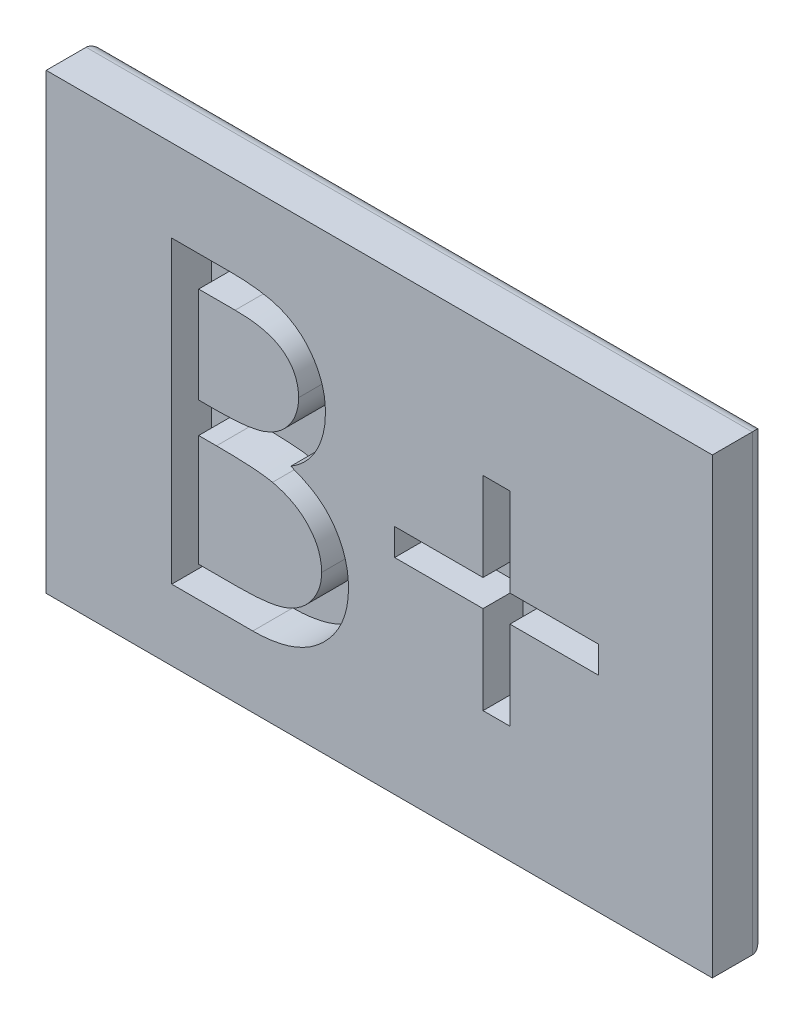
ISO-10303-21;
HEADER;
FILE_DESCRIPTION(('STEP AP214'),'2;1');
FILE_NAME('part.step','',(''),(''),'','','');
FILE_SCHEMA(('AUTOMOTIVE_DESIGN { 1 0 10303 214 1 1 1 1 }'));
ENDSEC;
DATA;
#1=APPLICATION_CONTEXT('core data for automotive mechanical design processes');
#2=APPLICATION_PROTOCOL_DEFINITION('international standard','automotive_design',2000,#1);
#3=PRODUCT_CONTEXT('',#1,'mechanical');
#4=PRODUCT('Part','Part','',(#3));
#5=PRODUCT_RELATED_PRODUCT_CATEGORY('part','',(#4));
#6=PRODUCT_DEFINITION_FORMATION('','',#4);
#7=PRODUCT_DEFINITION_CONTEXT('part definition',#1,'design');
#8=PRODUCT_DEFINITION('design','',#6,#7);
#9=PRODUCT_DEFINITION_SHAPE('','',#8);
#10=(LENGTH_UNIT() NAMED_UNIT(*) SI_UNIT(.MILLI.,.METRE.));
#11=(NAMED_UNIT(*) PLANE_ANGLE_UNIT() SI_UNIT($,.RADIAN.));
#12=(NAMED_UNIT(*) SI_UNIT($,.STERADIAN.) SOLID_ANGLE_UNIT());
#13=UNCERTAINTY_MEASURE_WITH_UNIT(LENGTH_MEASURE(1.E-05),#10,'distance_accuracy_value','');
#14=(GEOMETRIC_REPRESENTATION_CONTEXT(3) GLOBAL_UNCERTAINTY_ASSIGNED_CONTEXT((#13)) GLOBAL_UNIT_ASSIGNED_CONTEXT((#10,
#11,#12)) REPRESENTATION_CONTEXT('',''));
#15=CARTESIAN_POINT('',(0.,0.,0.));
#16=DIRECTION('',(0.,0.,1.));
#17=DIRECTION('',(1.,0.,0.));
#18=AXIS2_PLACEMENT_3D('',#15,#16,#17);
#19=CARTESIAN_POINT('',(0.,0.,2.54));
#20=DIRECTION('',(0.,0.,-1.));
#21=DIRECTION('',(-1.,0.,0.));
#22=AXIS2_PLACEMENT_3D('',#19,#20,#21);
#23=PLANE('',#22);
#24=DIRECTION('',(1.,0.,0.));
#25=VECTOR('',#24,1.);
#26=CARTESIAN_POINT('',(0.732692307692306,0.270538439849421,2.54));
#27=LINE('',#26,#25);
#28=CARTESIAN_POINT('',(0.732692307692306,0.270538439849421,2.54));
#29=VERTEX_POINT('',#28);
#30=CARTESIAN_POINT('',(4.94567307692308,0.270538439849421,2.54));
#31=VERTEX_POINT('',#30);
#32=EDGE_CURVE('E703',#29,#31,#27,.T.);
#33=ORIENTED_EDGE('',*,*,#32,.T.);
#34=DIRECTION('',(0.,1.,0.));
#35=VECTOR('',#34,1.);
#36=CARTESIAN_POINT('',(4.94567307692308,0.270538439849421,2.54));
#37=LINE('',#36,#35);
#38=CARTESIAN_POINT('',(4.94567307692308,4.48351920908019,2.54));
#39=VERTEX_POINT('',#38);
#40=EDGE_CURVE('E699',#31,#39,#37,.T.);
#41=ORIENTED_EDGE('',*,*,#40,.T.);
#42=DIRECTION('',(1.,0.,0.));
#43=VECTOR('',#42,1.);
#44=CARTESIAN_POINT('',(4.94567307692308,4.48351920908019,2.54));
#45=LINE('',#44,#43);
#46=CARTESIAN_POINT('',(6.22788461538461,4.48351920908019,2.54));
#47=VERTEX_POINT('',#46);
#48=EDGE_CURVE('E695',#39,#47,#45,.T.);
#49=ORIENTED_EDGE('',*,*,#48,.T.);
#50=DIRECTION('',(0.,-1.,0.));
#51=VECTOR('',#50,1.);
#52=CARTESIAN_POINT('',(6.22788461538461,4.48351920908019,2.54));
#53=LINE('',#52,#51);
#54=CARTESIAN_POINT('',(6.22788461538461,0.270538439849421,2.54));
#55=VERTEX_POINT('',#54);
#56=EDGE_CURVE('E691',#47,#55,#53,.T.);
#57=ORIENTED_EDGE('',*,*,#56,.T.);
#58=DIRECTION('',(1.,0.,0.));
#59=VECTOR('',#58,1.);
#60=CARTESIAN_POINT('',(6.22788461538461,0.270538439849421,2.54));
#61=LINE('',#60,#59);
#62=CARTESIAN_POINT('',(10.4408653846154,0.270538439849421,2.54));
#63=VERTEX_POINT('',#62);
#64=EDGE_CURVE('E687',#55,#63,#61,.T.);
#65=ORIENTED_EDGE('',*,*,#64,.T.);
#66=DIRECTION('',(0.,-1.,0.));
#67=VECTOR('',#66,1.);
#68=CARTESIAN_POINT('',(10.4408653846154,0.270538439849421,2.54));
#69=LINE('',#68,#67);
#70=CARTESIAN_POINT('',(10.4408653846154,-1.01167309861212,2.54));
#71=VERTEX_POINT('',#70);
#72=EDGE_CURVE('E683',#63,#71,#69,.T.);
#73=ORIENTED_EDGE('',*,*,#72,.T.);
#74=DIRECTION('',(-1.,0.,0.));
#75=VECTOR('',#74,1.);
#76=CARTESIAN_POINT('',(10.4408653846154,-1.01167309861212,2.54));
#77=LINE('',#76,#75);
#78=CARTESIAN_POINT('',(6.22788461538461,-1.01167309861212,2.54));
#79=VERTEX_POINT('',#78);
#80=EDGE_CURVE('E679',#71,#79,#77,.T.);
#81=ORIENTED_EDGE('',*,*,#80,.T.);
#82=DIRECTION('',(0.,-1.,0.));
#83=VECTOR('',#82,1.);
#84=CARTESIAN_POINT('',(6.22788461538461,-1.01167309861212,2.54));
#85=LINE('',#84,#83);
#86=CARTESIAN_POINT('',(6.22788461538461,-5.22465386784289,2.54));
#87=VERTEX_POINT('',#86);
#88=EDGE_CURVE('E675',#79,#87,#85,.T.);
#89=ORIENTED_EDGE('',*,*,#88,.T.);
#90=DIRECTION('',(-1.,0.,0.));
#91=VECTOR('',#90,1.);
#92=CARTESIAN_POINT('',(6.22788461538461,-5.22465386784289,2.54));
#93=LINE('',#92,#91);
#94=CARTESIAN_POINT('',(4.94567307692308,-5.22465386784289,2.54));
#95=VERTEX_POINT('',#94);
#96=EDGE_CURVE('E671',#87,#95,#93,.T.);
#97=ORIENTED_EDGE('',*,*,#96,.T.);
#98=DIRECTION('',(0.,1.,0.));
#99=VECTOR('',#98,1.);
#100=CARTESIAN_POINT('',(4.94567307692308,-5.22465386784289,2.54));
#101=LINE('',#100,#99);
#102=CARTESIAN_POINT('',(4.94567307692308,-1.01167309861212,2.54));
#103=VERTEX_POINT('',#102);
#104=EDGE_CURVE('E667',#95,#103,#101,.T.);
#105=ORIENTED_EDGE('',*,*,#104,.T.);
#106=DIRECTION('',(-1.,0.,0.));
#107=VECTOR('',#106,1.);
#108=CARTESIAN_POINT('',(4.94567307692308,-1.01167309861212,2.54));
#109=LINE('',#108,#107);
#110=CARTESIAN_POINT('',(0.732692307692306,-1.01167309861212,2.54));
#111=VERTEX_POINT('',#110);
#112=EDGE_CURVE('E663',#103,#111,#109,.T.);
#113=ORIENTED_EDGE('',*,*,#112,.T.);
#114=DIRECTION('',(0.,1.,0.));
#115=VECTOR('',#114,1.);
#116=CARTESIAN_POINT('',(0.732692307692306,-1.01167309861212,2.54));
#117=LINE('',#116,#115);
#118=EDGE_CURVE('E658',#111,#29,#117,.T.);
#119=ORIENTED_EDGE('',*,*,#118,.T.);
#120=EDGE_LOOP('',(#33,#41,#49,#57,#65,#73,#81,#89,#97,#105,#113,#119));
#121=FACE_BOUND('',#120,.T.);
#122=DIRECTION('',(0.,1.,0.));
#123=VECTOR('',#122,1.);
#124=CARTESIAN_POINT('',(15.875,-10.795,2.54));
#125=LINE('',#124,#123);
#126=CARTESIAN_POINT('',(15.875,-10.795,2.54));
#127=VERTEX_POINT('',#126);
#128=CARTESIAN_POINT('',(15.875,10.795,2.54));
#129=VERTEX_POINT('',#128);
#130=EDGE_CURVE('E555',#127,#129,#125,.T.);
#131=ORIENTED_EDGE('',*,*,#130,.T.);
#132=DIRECTION('',(-1.,0.,0.));
#133=VECTOR('',#132,1.);
#134=CARTESIAN_POINT('',(-15.875,10.795,2.54));
#135=LINE('',#134,#133);
#136=CARTESIAN_POINT('',(-15.875,10.795,2.54));
#137=VERTEX_POINT('',#136);
#138=EDGE_CURVE('E560',#129,#137,#135,.T.);
#139=ORIENTED_EDGE('',*,*,#138,.T.);
#140=DIRECTION('',(0.,-1.,0.));
#141=VECTOR('',#140,1.);
#142=CARTESIAN_POINT('',(-15.875,-10.795,2.54));
#143=LINE('',#142,#141);
#144=CARTESIAN_POINT('',(-15.875,-10.795,2.54));
#145=VERTEX_POINT('',#144);
#146=EDGE_CURVE('E613',#137,#145,#143,.T.);
#147=ORIENTED_EDGE('',*,*,#146,.T.);
#148=DIRECTION('',(1.,0.,0.));
#149=VECTOR('',#148,1.);
#150=CARTESIAN_POINT('',(-15.875,-10.795,2.54));
#151=LINE('',#150,#149);
#152=EDGE_CURVE('E610',#145,#127,#151,.T.);
#153=ORIENTED_EDGE('',*,*,#152,.T.);
#154=EDGE_LOOP('',(#131,#139,#147,#153));
#155=FACE_BOUND('',#154,.T.);
#156=DIRECTION('',(0.,1.,0.));
#157=VECTOR('',#156,1.);
#158=CARTESIAN_POINT('',(-9.89134615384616,-7.42273079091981,2.54));
#159=LINE('',#158,#157);
#160=CARTESIAN_POINT('',(-9.89134615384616,-7.42273079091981,2.54));
#161=VERTEX_POINT('',#160);
#162=CARTESIAN_POINT('',(-9.89134615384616,6.86476920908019,2.54));
#163=VERTEX_POINT('',#162);
#164=EDGE_CURVE('E56',#161,#163,#159,.T.);
#165=ORIENTED_EDGE('',*,*,#164,.T.);
#166=DIRECTION('',(1.,0.,0.));
#167=VECTOR('',#166,1.);
#168=CARTESIAN_POINT('',(-9.89134615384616,6.86476920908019,2.54));
#169=LINE('',#168,#167);
#170=CARTESIAN_POINT('',(-7.10368088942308,6.86476920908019,2.54));
#171=VERTEX_POINT('',#170);
#172=EDGE_CURVE('E799',#163,#171,#169,.T.);
#173=ORIENTED_EDGE('',*,*,#172,.T.);
#174=CARTESIAN_POINT('',(-7.10368088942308,6.86476920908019,2.54));
#175=CARTESIAN_POINT('',(-6.96722106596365,6.86405177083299,2.54));
#176=CARTESIAN_POINT('',(-6.7027279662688,6.86266119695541,2.54));
#177=CARTESIAN_POINT('',(-6.31811074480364,6.84109470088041,2.54));
#178=CARTESIAN_POINT('',(-5.95786649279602,6.81168829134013,2.54));
#179=CARTESIAN_POINT('',(-5.62189073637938,6.7650290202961,2.54));
#180=CARTESIAN_POINT('',(-5.3103387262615,6.70872901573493,2.54));
#181=CARTESIAN_POINT('',(-5.02227154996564,6.6405498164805,2.54));
#182=CARTESIAN_POINT('',(-4.75860523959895,6.55879831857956,2.54));
#183=CARTESIAN_POINT('',(-4.44382003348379,6.42879724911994,2.54));
#184=CARTESIAN_POINT('',(-4.08491533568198,6.23561731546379,2.54));
#185=CARTESIAN_POINT('',(-3.69630189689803,5.95015892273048,2.54));
#186=CARTESIAN_POINT('',(-3.36399816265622,5.60100318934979,2.54));
#187=CARTESIAN_POINT('',(-3.07748758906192,5.20714720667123,2.54));
#188=CARTESIAN_POINT('',(-2.84969944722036,4.77388582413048,2.54));
#189=CARTESIAN_POINT('',(-2.68490620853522,4.31154563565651,2.54));
#190=CARTESIAN_POINT('',(-2.58057531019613,3.82609009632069,2.54));
#191=CARTESIAN_POINT('',(-2.56984566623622,3.49281098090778,2.54));
#192=CARTESIAN_POINT('',(-2.56442307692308,3.32437708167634,2.54));
#193=B_SPLINE_CURVE_WITH_KNOTS('',3,(#174,#175,#176,#177,#178,#179,#180,#181,#182,#183,#184,
#185,#186,#187,#188,#189,#190,#191,#192),.UNSPECIFIED.,.F.,.F.,(4,1,1,1,1,1,1,1,1,1,1,1,1,1,1,1,
4),(0.,0.0625940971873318,0.12132293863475,0.176680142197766,0.228365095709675,
0.276868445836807,0.321879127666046,0.364098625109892,0.403355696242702,0.477967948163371,
0.550535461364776,0.623584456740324,0.698174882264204,0.773353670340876,0.847281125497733,
0.922818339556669,1.),.UNSPECIFIED.);
#194=CARTESIAN_POINT('',(-2.56442307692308,3.32437708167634,2.54));
#195=VERTEX_POINT('',#194);
#196=EDGE_CURVE('E790',#171,#195,#193,.T.);
#197=ORIENTED_EDGE('',*,*,#196,.T.);
#198=CARTESIAN_POINT('',(-2.56442307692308,3.32437708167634,2.54));
#199=CARTESIAN_POINT('',(-2.56888575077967,3.16659182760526,2.54));
#200=CARTESIAN_POINT('',(-2.57765532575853,2.85652892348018,2.54));
#201=CARTESIAN_POINT('',(-2.66151380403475,2.40302689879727,2.54));
#202=CARTESIAN_POINT('',(-2.79279824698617,1.97133531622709,2.54));
#203=CARTESIAN_POINT('',(-2.97529146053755,1.5630296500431,2.54));
#204=CARTESIAN_POINT('',(-3.21247210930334,1.18733529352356,2.54));
#205=CARTESIAN_POINT('',(-3.49356160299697,0.841221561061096,2.54));
#206=CARTESIAN_POINT('',(-3.83269297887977,0.539342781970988,2.54));
#207=CARTESIAN_POINT('',(-4.08677877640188,0.370575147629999,2.54));
#208=CARTESIAN_POINT('',(-4.2158428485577,0.284848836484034,2.54));
#209=B_SPLINE_CURVE_WITH_KNOTS('',3,(#198,#199,#200,#201,#202,#203,#204,#205,#206,#207,#208),
.UNSPECIFIED.,.F.,.F.,(4,1,1,1,1,1,1,1,4),(0.,0.13056910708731,0.256580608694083,
0.380551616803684,0.503622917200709,0.625739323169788,0.747548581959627,0.871766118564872,1.),.UNSPECIFIED.);
#210=CARTESIAN_POINT('',(-4.2158428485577,0.284848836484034,2.54));
#211=VERTEX_POINT('',#210);
#212=EDGE_CURVE('E781',#195,#211,#209,.T.);
#213=ORIENTED_EDGE('',*,*,#212,.T.);
#214=CARTESIAN_POINT('',(-4.2158428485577,0.284848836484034,2.54));
#215=CARTESIAN_POINT('',(-4.05353510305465,0.222534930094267,2.54));
#216=CARTESIAN_POINT('',(-3.74300017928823,0.103312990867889,2.54));
#217=CARTESIAN_POINT('',(-3.31565692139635,-0.107470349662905,2.54));
#218=CARTESIAN_POINT('',(-2.94746867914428,-0.336732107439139,2.54));
#219=CARTESIAN_POINT('',(-2.63560461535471,-0.587097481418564,2.54));
#220=CARTESIAN_POINT('',(-2.36888697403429,-0.856963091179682,2.54));
#221=CARTESIAN_POINT('',(-2.13598871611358,-1.15028593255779,2.54));
#222=CARTESIAN_POINT('',(-1.93726439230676,-1.47089236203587,2.54));
#223=CARTESIAN_POINT('',(-1.76698627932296,-1.81543965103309,2.54));
#224=CARTESIAN_POINT('',(-1.63411760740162,-2.18040962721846,2.54));
#225=CARTESIAN_POINT('',(-1.53461168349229,-2.56237890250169,2.54));
#226=CARTESIAN_POINT('',(-1.47759456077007,-2.95997780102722,2.54));
#227=CARTESIAN_POINT('',(-1.46948072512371,-3.23056418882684,2.54));
#228=CARTESIAN_POINT('',(-1.46538461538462,-3.36716438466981,2.54));
#229=B_SPLINE_CURVE_WITH_KNOTS('',3,(#214,#215,#216,#217,#218,#219,#220,#221,#222,#223,#224,
#225,#226,#227,#228),.UNSPECIFIED.,.F.,.F.,(4,1,1,1,1,1,1,1,1,1,1,1,4),(0.,0.106057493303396,
0.20291425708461,0.290300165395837,0.37022256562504,0.44638372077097,0.521396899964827,
0.598291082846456,0.676142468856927,0.755528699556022,0.834887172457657,0.916646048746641,1.),.UNSPECIFIED.);
#230=CARTESIAN_POINT('',(-1.46538461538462,-3.36716438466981,2.54));
#231=VERTEX_POINT('',#230);
#232=EDGE_CURVE('E772',#211,#231,#229,.T.);
#233=ORIENTED_EDGE('',*,*,#232,.T.);
#234=CARTESIAN_POINT('',(-1.46538461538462,-3.36716438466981,2.54));
#235=CARTESIAN_POINT('',(-1.4693722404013,-3.50663843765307,2.54));
#236=CARTESIAN_POINT('',(-1.47721800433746,-3.78105754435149,2.54));
#237=CARTESIAN_POINT('',(-1.53510267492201,-4.184190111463,2.54));
#238=CARTESIAN_POINT('',(-1.63311127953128,-4.56944212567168,2.54));
#239=CARTESIAN_POINT('',(-1.76811242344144,-4.93930542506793,2.54));
#240=CARTESIAN_POINT('',(-1.94430715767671,-5.29306447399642,2.54));
#241=CARTESIAN_POINT('',(-2.15873381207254,-5.63112004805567,2.54));
#242=CARTESIAN_POINT('',(-2.4144048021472,-5.95007554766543,2.54));
#243=CARTESIAN_POINT('',(-2.70041144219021,-6.25347519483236,2.54));
#244=CARTESIAN_POINT('',(-3.02397084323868,-6.52627576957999,2.54));
#245=CARTESIAN_POINT('',(-3.37305837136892,-6.76922738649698,2.54));
#246=CARTESIAN_POINT('',(-3.75207031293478,-6.96903220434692,2.54));
#247=CARTESIAN_POINT('',(-4.15478184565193,-7.1368736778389,2.54));
#248=CARTESIAN_POINT('',(-4.58571046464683,-7.26508234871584,2.54));
#249=CARTESIAN_POINT('',(-5.04292110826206,-7.35477753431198,2.54));
#250=CARTESIAN_POINT('',(-5.52601945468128,-7.41521381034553,2.54));
#251=CARTESIAN_POINT('',(-5.85752926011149,-7.42018261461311,2.54));
#252=CARTESIAN_POINT('',(-6.0275390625,-7.42273079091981,2.54));
#253=B_SPLINE_CURVE_WITH_KNOTS('',3,(#234,#235,#236,#237,#238,#239,#240,#241,#242,#243,#244,
#245,#246,#247,#248,#249,#250,#251,#252),.UNSPECIFIED.,.F.,.F.,(4,1,1,1,1,1,1,1,1,1,1,1,1,1,1,1,
4),(0.,0.0611602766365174,0.120334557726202,0.178180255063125,0.235235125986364,
0.29268296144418,0.35118624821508,0.410456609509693,0.471719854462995,0.533761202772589,
0.595739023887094,0.657887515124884,0.721295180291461,0.786822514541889,0.854686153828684,
0.925477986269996,1.),.UNSPECIFIED.);
#254=CARTESIAN_POINT('',(-6.0275390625,-7.42273079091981,2.54));
#255=VERTEX_POINT('',#254);
#256=EDGE_CURVE('E766',#231,#255,#253,.T.);
#257=ORIENTED_EDGE('',*,*,#256,.T.);
#258=DIRECTION('',(-1.,0.,0.));
#259=VECTOR('',#258,1.);
#260=CARTESIAN_POINT('',(-6.0275390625,-7.42273079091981,2.54));
#261=LINE('',#260,#259);
#262=EDGE_CURVE('E423',#255,#161,#261,.T.);
#263=ORIENTED_EDGE('',*,*,#262,.T.);
#264=EDGE_LOOP('',(#165,#173,#197,#213,#233,#257,#263));
#265=FACE_BOUND('',#264,.T.);
#266=ADVANCED_FACE('F38',(#121,#155,#265),#23,.F.);
#267=CARTESIAN_POINT('',(15.875,-10.795,2.54));
#268=DIRECTION('',(-1.,0.,0.));
#269=DIRECTION('',(0.,0.,1.));
#270=AXIS2_PLACEMENT_3D('',#267,#268,#269);
#271=PLANE('',#270);
#272=DIRECTION('',(0.,0.,-1.));
#273=VECTOR('',#272,1.);
#274=CARTESIAN_POINT('',(15.875,-10.795,2.54));
#275=LINE('',#274,#273);
#276=CARTESIAN_POINT('',(15.875,-10.795,0.635));
#277=VERTEX_POINT('',#276);
#278=EDGE_CURVE('E606',#127,#277,#275,.T.);
#279=ORIENTED_EDGE('',*,*,#278,.T.);
#280=DIRECTION('',(0.,1.,0.));
#281=VECTOR('',#280,1.);
#282=CARTESIAN_POINT('',(15.875,10.795,0.635));
#283=LINE('',#282,#281);
#284=CARTESIAN_POINT('',(15.875,10.795,0.635));
#285=VERTEX_POINT('',#284);
#286=EDGE_CURVE('E11',#277,#285,#283,.T.);
#287=ORIENTED_EDGE('',*,*,#286,.T.);
#288=DIRECTION('',(0.,0.,-1.));
#289=VECTOR('',#288,1.);
#290=CARTESIAN_POINT('',(15.875,10.795,2.54));
#291=LINE('',#290,#289);
#292=EDGE_CURVE('E594',#129,#285,#291,.T.);
#293=ORIENTED_EDGE('',*,*,#292,.F.);
#294=ORIENTED_EDGE('',*,*,#130,.F.);
#295=EDGE_LOOP('',(#279,#287,#293,#294));
#296=FACE_BOUND('',#295,.T.);
#297=ADVANCED_FACE('F510',(#296),#271,.F.);
#298=CARTESIAN_POINT('',(-15.875,10.795,2.54));
#299=DIRECTION('',(0.,-1.,0.));
#300=DIRECTION('',(0.,0.,-1.));
#301=AXIS2_PLACEMENT_3D('',#298,#299,#300);
#302=PLANE('',#301);
#303=ORIENTED_EDGE('',*,*,#292,.T.);
#304=DIRECTION('',(-1.,0.,0.));
#305=VECTOR('',#304,1.);
#306=CARTESIAN_POINT('',(-15.875,10.795,0.635));
#307=LINE('',#306,#305);
#308=CARTESIAN_POINT('',(-15.875,10.795,0.635));
#309=VERTEX_POINT('',#308);
#310=EDGE_CURVE('E48',#285,#309,#307,.T.);
#311=ORIENTED_EDGE('',*,*,#310,.T.);
#312=DIRECTION('',(0.,0.,-1.));
#313=VECTOR('',#312,1.);
#314=CARTESIAN_POINT('',(-15.875,10.795,2.54));
#315=LINE('',#314,#313);
#316=EDGE_CURVE('E598',#137,#309,#315,.T.);
#317=ORIENTED_EDGE('',*,*,#316,.F.);
#318=ORIENTED_EDGE('',*,*,#138,.F.);
#319=EDGE_LOOP('',(#303,#311,#317,#318));
#320=FACE_BOUND('',#319,.T.);
#321=ADVANCED_FACE('F524',(#320),#302,.F.);
#322=CARTESIAN_POINT('',(-15.875,-10.795,2.54));
#323=DIRECTION('',(1.,0.,0.));
#324=DIRECTION('',(0.,0.,-1.));
#325=AXIS2_PLACEMENT_3D('',#322,#323,#324);
#326=PLANE('',#325);
#327=ORIENTED_EDGE('',*,*,#316,.T.);
#328=DIRECTION('',(0.,-1.,0.));
#329=VECTOR('',#328,1.);
#330=CARTESIAN_POINT('',(-15.875,-10.795,0.635));
#331=LINE('',#330,#329);
#332=CARTESIAN_POINT('',(-15.875,-10.795,0.635));
#333=VERTEX_POINT('',#332);
#334=EDGE_CURVE('E590',#309,#333,#331,.T.);
#335=ORIENTED_EDGE('',*,*,#334,.T.);
#336=DIRECTION('',(0.,0.,-1.));
#337=VECTOR('',#336,1.);
#338=CARTESIAN_POINT('',(-15.875,-10.795,2.54));
#339=LINE('',#338,#337);
#340=EDGE_CURVE('E602',#145,#333,#339,.T.);
#341=ORIENTED_EDGE('',*,*,#340,.F.);
#342=ORIENTED_EDGE('',*,*,#146,.F.);
#343=EDGE_LOOP('',(#327,#335,#341,#342));
#344=FACE_BOUND('',#343,.T.);
#345=ADVANCED_FACE('F520',(#344),#326,.F.);
#346=CARTESIAN_POINT('',(-15.875,-10.795,2.54));
#347=DIRECTION('',(0.,1.,0.));
#348=DIRECTION('',(0.,0.,1.));
#349=AXIS2_PLACEMENT_3D('',#346,#347,#348);
#350=PLANE('',#349);
#351=ORIENTED_EDGE('',*,*,#340,.T.);
#352=DIRECTION('',(1.,0.,0.));
#353=VECTOR('',#352,1.);
#354=CARTESIAN_POINT('',(15.875,-10.795,0.635));
#355=LINE('',#354,#353);
#356=EDGE_CURVE('E576',#333,#277,#355,.T.);
#357=ORIENTED_EDGE('',*,*,#356,.T.);
#358=ORIENTED_EDGE('',*,*,#278,.F.);
#359=ORIENTED_EDGE('',*,*,#152,.F.);
#360=EDGE_LOOP('',(#351,#357,#358,#359));
#361=FACE_BOUND('',#360,.T.);
#362=ADVANCED_FACE('F516',(#361),#350,.F.);
#363=CARTESIAN_POINT('',(0.,0.,0.));
#364=DIRECTION('',(0.,0.,-1.));
#365=DIRECTION('',(-1.,0.,0.));
#366=AXIS2_PLACEMENT_3D('',#363,#364,#365);
#367=PLANE('',#366);
#368=DIRECTION('',(1.,0.,0.));
#369=VECTOR('',#368,1.);
#370=CARTESIAN_POINT('',(-15.875,-10.16,0.));
#371=LINE('',#370,#369);
#372=CARTESIAN_POINT('',(15.24,-10.16,0.));
#373=VERTEX_POINT('',#372);
#374=CARTESIAN_POINT('',(-15.24,-10.16,0.));
#375=VERTEX_POINT('',#374);
#376=EDGE_CURVE('E582',#373,#375,#371,.F.);
#377=ORIENTED_EDGE('',*,*,#376,.T.);
#378=DIRECTION('',(0.,-1.,0.));
#379=VECTOR('',#378,1.);
#380=CARTESIAN_POINT('',(-15.24,10.795,0.));
#381=LINE('',#380,#379);
#382=CARTESIAN_POINT('',(-15.24,10.16,0.));
#383=VERTEX_POINT('',#382);
#384=EDGE_CURVE('E579',#375,#383,#381,.F.);
#385=ORIENTED_EDGE('',*,*,#384,.T.);
#386=DIRECTION('',(-1.,0.,0.));
#387=VECTOR('',#386,1.);
#388=CARTESIAN_POINT('',(15.875,10.16,0.));
#389=LINE('',#388,#387);
#390=CARTESIAN_POINT('',(15.24,10.16,0.));
#391=VERTEX_POINT('',#390);
#392=EDGE_CURVE('E550',#383,#391,#389,.F.);
#393=ORIENTED_EDGE('',*,*,#392,.T.);
#394=DIRECTION('',(0.,1.,0.));
#395=VECTOR('',#394,1.);
#396=CARTESIAN_POINT('',(15.24,-10.795,0.));
#397=LINE('',#396,#395);
#398=EDGE_CURVE('E587',#391,#373,#397,.F.);
#399=ORIENTED_EDGE('',*,*,#398,.T.);
#400=EDGE_LOOP('',(#377,#385,#393,#399));
#401=FACE_BOUND('',#400,.T.);
#402=ADVANCED_FACE('F513',(#401),#367,.T.);
#403=CARTESIAN_POINT('',(15.24,-10.795,0.635));
#404=DIRECTION('',(0.,-1.,0.));
#405=DIRECTION('',(0.,0.,-1.));
#406=AXIS2_PLACEMENT_3D('',#403,#404,#405);
#407=CYLINDRICAL_SURFACE('',#406,0.635);
#408=CARTESIAN_POINT('',(15.24,-10.16,0.635));
#409=DIRECTION('',(-0.707106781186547,-0.707106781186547,0.));
#410=DIRECTION('',(0.707106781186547,-0.707106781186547,0.));
#411=AXIS2_PLACEMENT_3D('',#408,#409,#410);
#412=ELLIPSE('',#411,0.898025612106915,0.635);
#413=EDGE_CURVE('E556',#373,#277,#412,.T.);
#414=ORIENTED_EDGE('',*,*,#413,.F.);
#415=ORIENTED_EDGE('',*,*,#398,.F.);
#416=CARTESIAN_POINT('',(15.24,10.16,0.635));
#417=DIRECTION('',(0.707106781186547,-0.707106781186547,0.));
#418=DIRECTION('',(-0.707106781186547,-0.707106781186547,0.));
#419=AXIS2_PLACEMENT_3D('',#416,#417,#418);
#420=ELLIPSE('',#419,0.898025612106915,0.635);
#421=EDGE_CURVE('E42',#285,#391,#420,.F.);
#422=ORIENTED_EDGE('',*,*,#421,.F.);
#423=ORIENTED_EDGE('',*,*,#286,.F.);
#424=EDGE_LOOP('',(#414,#415,#422,#423));
#425=FACE_BOUND('',#424,.T.);
#426=ADVANCED_FACE('F40',(#425),#407,.T.);
#427=CARTESIAN_POINT('',(-15.875,10.16,0.635));
#428=DIRECTION('',(1.,0.,0.));
#429=DIRECTION('',(0.,0.,-1.));
#430=AXIS2_PLACEMENT_3D('',#427,#428,#429);
#431=CYLINDRICAL_SURFACE('',#430,0.635);
#432=ORIENTED_EDGE('',*,*,#421,.T.);
#433=ORIENTED_EDGE('',*,*,#392,.F.);
#434=CARTESIAN_POINT('',(-15.24,10.16,0.635));
#435=DIRECTION('',(0.707106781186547,0.707106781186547,0.));
#436=DIRECTION('',(0.707106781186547,-0.707106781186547,0.));
#437=AXIS2_PLACEMENT_3D('',#434,#435,#436);
#438=ELLIPSE('',#437,0.898025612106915,0.635);
#439=EDGE_CURVE('E563',#309,#383,#438,.F.);
#440=ORIENTED_EDGE('',*,*,#439,.F.);
#441=ORIENTED_EDGE('',*,*,#310,.F.);
#442=EDGE_LOOP('',(#432,#433,#440,#441));
#443=FACE_BOUND('',#442,.T.);
#444=ADVANCED_FACE('F537',(#443),#431,.T.);
#445=CARTESIAN_POINT('',(-15.875,-10.16,0.635));
#446=DIRECTION('',(-1.,0.,0.));
#447=DIRECTION('',(0.,0.,1.));
#448=AXIS2_PLACEMENT_3D('',#445,#446,#447);
#449=CYLINDRICAL_SURFACE('',#448,0.635);
#450=ORIENTED_EDGE('',*,*,#413,.T.);
#451=ORIENTED_EDGE('',*,*,#356,.F.);
#452=CARTESIAN_POINT('',(-15.24,-10.16,0.635));
#453=DIRECTION('',(-0.707106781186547,0.707106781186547,0.));
#454=DIRECTION('',(-0.707106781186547,-0.707106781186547,0.));
#455=AXIS2_PLACEMENT_3D('',#452,#453,#454);
#456=ELLIPSE('',#455,0.898025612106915,0.635);
#457=EDGE_CURVE('E568',#375,#333,#456,.T.);
#458=ORIENTED_EDGE('',*,*,#457,.F.);
#459=ORIENTED_EDGE('',*,*,#376,.F.);
#460=EDGE_LOOP('',(#450,#451,#458,#459));
#461=FACE_BOUND('',#460,.T.);
#462=ADVANCED_FACE('F534',(#461),#449,.T.);
#463=CARTESIAN_POINT('',(-15.24,-10.795,0.635));
#464=DIRECTION('',(0.,1.,0.));
#465=DIRECTION('',(0.,0.,1.));
#466=AXIS2_PLACEMENT_3D('',#463,#464,#465);
#467=CYLINDRICAL_SURFACE('',#466,0.635);
#468=ORIENTED_EDGE('',*,*,#439,.T.);
#469=ORIENTED_EDGE('',*,*,#384,.F.);
#470=ORIENTED_EDGE('',*,*,#457,.T.);
#471=ORIENTED_EDGE('',*,*,#334,.F.);
#472=EDGE_LOOP('',(#468,#469,#470,#471));
#473=FACE_BOUND('',#472,.T.);
#474=ADVANCED_FACE('F506',(#473),#467,.T.);
#475=CARTESIAN_POINT('',(0.732692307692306,0.270538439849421,0.635));
#476=DIRECTION('',(0.,-1.,0.));
#477=DIRECTION('',(0.,0.,-1.));
#478=AXIS2_PLACEMENT_3D('',#475,#476,#477);
#479=PLANE('',#478);
#480=ORIENTED_EDGE('',*,*,#32,.F.);
#481=DIRECTION('',(0.,0.,1.));
#482=VECTOR('',#481,1.);
#483=CARTESIAN_POINT('',(0.732692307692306,0.270538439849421,0.635));
#484=LINE('',#483,#482);
#485=CARTESIAN_POINT('',(0.732692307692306,0.270538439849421,0.635));
#486=VERTEX_POINT('',#485);
#487=EDGE_CURVE('E653',#486,#29,#484,.T.);
#488=ORIENTED_EDGE('',*,*,#487,.F.);
#489=DIRECTION('',(1.,0.,0.));
#490=VECTOR('',#489,1.);
#491=CARTESIAN_POINT('',(0.732692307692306,0.270538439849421,0.635));
#492=LINE('',#491,#490);
#493=CARTESIAN_POINT('',(4.94567307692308,0.270538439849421,0.635));
#494=VERTEX_POINT('',#493);
#495=EDGE_CURVE('E662',#486,#494,#492,.T.);
#496=ORIENTED_EDGE('',*,*,#495,.T.);
#497=DIRECTION('',(0.,0.,1.));
#498=VECTOR('',#497,1.);
#499=CARTESIAN_POINT('',(4.94567307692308,0.270538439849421,0.635));
#500=LINE('',#499,#498);
#501=EDGE_CURVE('E618',#494,#31,#500,.T.);
#502=ORIENTED_EDGE('',*,*,#501,.T.);
#503=EDGE_LOOP('',(#480,#488,#496,#502));
#504=FACE_BOUND('',#503,.T.);
#505=ADVANCED_FACE('F502',(#504),#479,.T.);
#506=CARTESIAN_POINT('',(4.94567307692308,0.270538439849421,0.635));
#507=DIRECTION('',(1.,0.,0.));
#508=DIRECTION('',(0.,0.,-1.));
#509=AXIS2_PLACEMENT_3D('',#506,#507,#508);
#510=PLANE('',#509);
#511=ORIENTED_EDGE('',*,*,#40,.F.);
#512=ORIENTED_EDGE('',*,*,#501,.F.);
#513=DIRECTION('',(0.,1.,0.));
#514=VECTOR('',#513,1.);
#515=CARTESIAN_POINT('',(4.94567307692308,0.270538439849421,0.635));
#516=LINE('',#515,#514);
#517=CARTESIAN_POINT('',(4.94567307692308,4.48351920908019,0.635));
#518=VERTEX_POINT('',#517);
#519=EDGE_CURVE('E736',#494,#518,#516,.T.);
#520=ORIENTED_EDGE('',*,*,#519,.T.);
#521=DIRECTION('',(0.,0.,1.));
#522=VECTOR('',#521,1.);
#523=CARTESIAN_POINT('',(4.94567307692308,4.48351920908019,0.635));
#524=LINE('',#523,#522);
#525=EDGE_CURVE('E623',#518,#39,#524,.T.);
#526=ORIENTED_EDGE('',*,*,#525,.T.);
#527=EDGE_LOOP('',(#511,#512,#520,#526));
#528=FACE_BOUND('',#527,.T.);
#529=ADVANCED_FACE('F498',(#528),#510,.T.);
#530=CARTESIAN_POINT('',(4.94567307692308,4.48351920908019,0.635));
#531=DIRECTION('',(0.,-1.,0.));
#532=DIRECTION('',(0.,0.,-1.));
#533=AXIS2_PLACEMENT_3D('',#530,#531,#532);
#534=PLANE('',#533);
#535=ORIENTED_EDGE('',*,*,#48,.F.);
#536=ORIENTED_EDGE('',*,*,#525,.F.);
#537=DIRECTION('',(1.,0.,0.));
#538=VECTOR('',#537,1.);
#539=CARTESIAN_POINT('',(4.94567307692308,4.48351920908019,0.635));
#540=LINE('',#539,#538);
#541=CARTESIAN_POINT('',(6.22788461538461,4.48351920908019,0.635));
#542=VERTEX_POINT('',#541);
#543=EDGE_CURVE('E733',#518,#542,#540,.T.);
#544=ORIENTED_EDGE('',*,*,#543,.T.);
#545=DIRECTION('',(0.,0.,1.));
#546=VECTOR('',#545,1.);
#547=CARTESIAN_POINT('',(6.22788461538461,4.48351920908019,0.635));
#548=LINE('',#547,#546);
#549=EDGE_CURVE('E626',#542,#47,#548,.T.);
#550=ORIENTED_EDGE('',*,*,#549,.T.);
#551=EDGE_LOOP('',(#535,#536,#544,#550));
#552=FACE_BOUND('',#551,.T.);
#553=ADVANCED_FACE('F494',(#552),#534,.T.);
#554=CARTESIAN_POINT('',(6.22788461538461,4.48351920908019,0.635));
#555=DIRECTION('',(-1.,0.,0.));
#556=DIRECTION('',(0.,0.,1.));
#557=AXIS2_PLACEMENT_3D('',#554,#555,#556);
#558=PLANE('',#557);
#559=ORIENTED_EDGE('',*,*,#56,.F.);
#560=ORIENTED_EDGE('',*,*,#549,.F.);
#561=DIRECTION('',(0.,-1.,0.));
#562=VECTOR('',#561,1.);
#563=CARTESIAN_POINT('',(6.22788461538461,4.48351920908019,0.635));
#564=LINE('',#563,#562);
#565=CARTESIAN_POINT('',(6.22788461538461,0.270538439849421,0.635));
#566=VERTEX_POINT('',#565);
#567=EDGE_CURVE('E730',#542,#566,#564,.T.);
#568=ORIENTED_EDGE('',*,*,#567,.T.);
#569=DIRECTION('',(0.,0.,1.));
#570=VECTOR('',#569,1.);
#571=CARTESIAN_POINT('',(6.22788461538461,0.270538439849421,0.635));
#572=LINE('',#571,#570);
#573=EDGE_CURVE('E629',#566,#55,#572,.T.);
#574=ORIENTED_EDGE('',*,*,#573,.T.);
#575=EDGE_LOOP('',(#559,#560,#568,#574));
#576=FACE_BOUND('',#575,.T.);
#577=ADVANCED_FACE('F490',(#576),#558,.T.);
#578=CARTESIAN_POINT('',(6.22788461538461,0.270538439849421,0.635));
#579=DIRECTION('',(0.,-1.,0.));
#580=DIRECTION('',(0.,0.,-1.));
#581=AXIS2_PLACEMENT_3D('',#578,#579,#580);
#582=PLANE('',#581);
#583=ORIENTED_EDGE('',*,*,#64,.F.);
#584=ORIENTED_EDGE('',*,*,#573,.F.);
#585=DIRECTION('',(1.,0.,0.));
#586=VECTOR('',#585,1.);
#587=CARTESIAN_POINT('',(6.22788461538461,0.270538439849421,0.635));
#588=LINE('',#587,#586);
#589=CARTESIAN_POINT('',(10.4408653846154,0.270538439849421,0.635));
#590=VERTEX_POINT('',#589);
#591=EDGE_CURVE('E727',#566,#590,#588,.T.);
#592=ORIENTED_EDGE('',*,*,#591,.T.);
#593=DIRECTION('',(0.,0.,1.));
#594=VECTOR('',#593,1.);
#595=CARTESIAN_POINT('',(10.4408653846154,0.270538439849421,0.635));
#596=LINE('',#595,#594);
#597=EDGE_CURVE('E632',#590,#63,#596,.T.);
#598=ORIENTED_EDGE('',*,*,#597,.T.);
#599=EDGE_LOOP('',(#583,#584,#592,#598));
#600=FACE_BOUND('',#599,.T.);
#601=ADVANCED_FACE('F486',(#600),#582,.T.);
#602=CARTESIAN_POINT('',(10.4408653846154,0.270538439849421,0.635));
#603=DIRECTION('',(-1.,0.,0.));
#604=DIRECTION('',(0.,0.,1.));
#605=AXIS2_PLACEMENT_3D('',#602,#603,#604);
#606=PLANE('',#605);
#607=ORIENTED_EDGE('',*,*,#72,.F.);
#608=ORIENTED_EDGE('',*,*,#597,.F.);
#609=DIRECTION('',(0.,-1.,0.));
#610=VECTOR('',#609,1.);
#611=CARTESIAN_POINT('',(10.4408653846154,0.270538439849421,0.635));
#612=LINE('',#611,#610);
#613=CARTESIAN_POINT('',(10.4408653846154,-1.01167309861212,0.635));
#614=VERTEX_POINT('',#613);
#615=EDGE_CURVE('E724',#590,#614,#612,.T.);
#616=ORIENTED_EDGE('',*,*,#615,.T.);
#617=DIRECTION('',(0.,0.,1.));
#618=VECTOR('',#617,1.);
#619=CARTESIAN_POINT('',(10.4408653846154,-1.01167309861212,0.635));
#620=LINE('',#619,#618);
#621=EDGE_CURVE('E635',#614,#71,#620,.T.);
#622=ORIENTED_EDGE('',*,*,#621,.T.);
#623=EDGE_LOOP('',(#607,#608,#616,#622));
#624=FACE_BOUND('',#623,.T.);
#625=ADVANCED_FACE('F482',(#624),#606,.T.);
#626=CARTESIAN_POINT('',(10.4408653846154,-1.01167309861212,0.635));
#627=DIRECTION('',(0.,1.,0.));
#628=DIRECTION('',(0.,0.,1.));
#629=AXIS2_PLACEMENT_3D('',#626,#627,#628);
#630=PLANE('',#629);
#631=ORIENTED_EDGE('',*,*,#80,.F.);
#632=ORIENTED_EDGE('',*,*,#621,.F.);
#633=DIRECTION('',(-1.,0.,0.));
#634=VECTOR('',#633,1.);
#635=CARTESIAN_POINT('',(10.4408653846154,-1.01167309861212,0.635));
#636=LINE('',#635,#634);
#637=CARTESIAN_POINT('',(6.22788461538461,-1.01167309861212,0.635));
#638=VERTEX_POINT('',#637);
#639=EDGE_CURVE('E721',#614,#638,#636,.T.);
#640=ORIENTED_EDGE('',*,*,#639,.T.);
#641=DIRECTION('',(0.,0.,1.));
#642=VECTOR('',#641,1.);
#643=CARTESIAN_POINT('',(6.22788461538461,-1.01167309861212,0.635));
#644=LINE('',#643,#642);
#645=EDGE_CURVE('E638',#638,#79,#644,.T.);
#646=ORIENTED_EDGE('',*,*,#645,.T.);
#647=EDGE_LOOP('',(#631,#632,#640,#646));
#648=FACE_BOUND('',#647,.T.);
#649=ADVANCED_FACE('F478',(#648),#630,.T.);
#650=CARTESIAN_POINT('',(6.22788461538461,-1.01167309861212,0.635));
#651=DIRECTION('',(-1.,0.,0.));
#652=DIRECTION('',(0.,0.,1.));
#653=AXIS2_PLACEMENT_3D('',#650,#651,#652);
#654=PLANE('',#653);
#655=ORIENTED_EDGE('',*,*,#88,.F.);
#656=ORIENTED_EDGE('',*,*,#645,.F.);
#657=DIRECTION('',(0.,-1.,0.));
#658=VECTOR('',#657,1.);
#659=CARTESIAN_POINT('',(6.22788461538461,-1.01167309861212,0.635));
#660=LINE('',#659,#658);
#661=CARTESIAN_POINT('',(6.22788461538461,-5.22465386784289,0.635));
#662=VERTEX_POINT('',#661);
#663=EDGE_CURVE('E718',#638,#662,#660,.T.);
#664=ORIENTED_EDGE('',*,*,#663,.T.);
#665=DIRECTION('',(0.,0.,1.));
#666=VECTOR('',#665,1.);
#667=CARTESIAN_POINT('',(6.22788461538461,-5.22465386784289,0.635));
#668=LINE('',#667,#666);
#669=EDGE_CURVE('E641',#662,#87,#668,.T.);
#670=ORIENTED_EDGE('',*,*,#669,.T.);
#671=EDGE_LOOP('',(#655,#656,#664,#670));
#672=FACE_BOUND('',#671,.T.);
#673=ADVANCED_FACE('F474',(#672),#654,.T.);
#674=CARTESIAN_POINT('',(6.22788461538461,-5.22465386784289,0.635));
#675=DIRECTION('',(0.,1.,0.));
#676=DIRECTION('',(0.,0.,1.));
#677=AXIS2_PLACEMENT_3D('',#674,#675,#676);
#678=PLANE('',#677);
#679=ORIENTED_EDGE('',*,*,#96,.F.);
#680=ORIENTED_EDGE('',*,*,#669,.F.);
#681=DIRECTION('',(-1.,0.,0.));
#682=VECTOR('',#681,1.);
#683=CARTESIAN_POINT('',(6.22788461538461,-5.22465386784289,0.635));
#684=LINE('',#683,#682);
#685=CARTESIAN_POINT('',(4.94567307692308,-5.22465386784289,0.635));
#686=VERTEX_POINT('',#685);
#687=EDGE_CURVE('E715',#662,#686,#684,.T.);
#688=ORIENTED_EDGE('',*,*,#687,.T.);
#689=DIRECTION('',(0.,0.,1.));
#690=VECTOR('',#689,1.);
#691=CARTESIAN_POINT('',(4.94567307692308,-5.22465386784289,0.635));
#692=LINE('',#691,#690);
#693=EDGE_CURVE('E644',#686,#95,#692,.T.);
#694=ORIENTED_EDGE('',*,*,#693,.T.);
#695=EDGE_LOOP('',(#679,#680,#688,#694));
#696=FACE_BOUND('',#695,.T.);
#697=ADVANCED_FACE('F470',(#696),#678,.T.);
#698=CARTESIAN_POINT('',(4.94567307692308,-5.22465386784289,0.635));
#699=DIRECTION('',(1.,0.,0.));
#700=DIRECTION('',(0.,0.,-1.));
#701=AXIS2_PLACEMENT_3D('',#698,#699,#700);
#702=PLANE('',#701);
#703=ORIENTED_EDGE('',*,*,#104,.F.);
#704=ORIENTED_EDGE('',*,*,#693,.F.);
#705=DIRECTION('',(0.,1.,0.));
#706=VECTOR('',#705,1.);
#707=CARTESIAN_POINT('',(4.94567307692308,-5.22465386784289,0.635));
#708=LINE('',#707,#706);
#709=CARTESIAN_POINT('',(4.94567307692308,-1.01167309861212,0.635));
#710=VERTEX_POINT('',#709);
#711=EDGE_CURVE('E712',#686,#710,#708,.T.);
#712=ORIENTED_EDGE('',*,*,#711,.T.);
#713=DIRECTION('',(0.,0.,1.));
#714=VECTOR('',#713,1.);
#715=CARTESIAN_POINT('',(4.94567307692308,-1.01167309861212,0.635));
#716=LINE('',#715,#714);
#717=EDGE_CURVE('E647',#710,#103,#716,.T.);
#718=ORIENTED_EDGE('',*,*,#717,.T.);
#719=EDGE_LOOP('',(#703,#704,#712,#718));
#720=FACE_BOUND('',#719,.T.);
#721=ADVANCED_FACE('F466',(#720),#702,.T.);
#722=CARTESIAN_POINT('',(4.94567307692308,-1.01167309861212,0.635));
#723=DIRECTION('',(0.,1.,0.));
#724=DIRECTION('',(0.,0.,1.));
#725=AXIS2_PLACEMENT_3D('',#722,#723,#724);
#726=PLANE('',#725);
#727=ORIENTED_EDGE('',*,*,#112,.F.);
#728=ORIENTED_EDGE('',*,*,#717,.F.);
#729=DIRECTION('',(-1.,0.,0.));
#730=VECTOR('',#729,1.);
#731=CARTESIAN_POINT('',(4.94567307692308,-1.01167309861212,0.635));
#732=LINE('',#731,#730);
#733=CARTESIAN_POINT('',(0.732692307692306,-1.01167309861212,0.635));
#734=VERTEX_POINT('',#733);
#735=EDGE_CURVE('E709',#710,#734,#732,.T.);
#736=ORIENTED_EDGE('',*,*,#735,.T.);
#737=DIRECTION('',(0.,0.,1.));
#738=VECTOR('',#737,1.);
#739=CARTESIAN_POINT('',(0.732692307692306,-1.01167309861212,0.635));
#740=LINE('',#739,#738);
#741=EDGE_CURVE('E650',#734,#111,#740,.T.);
#742=ORIENTED_EDGE('',*,*,#741,.T.);
#743=EDGE_LOOP('',(#727,#728,#736,#742));
#744=FACE_BOUND('',#743,.T.);
#745=ADVANCED_FACE('F462',(#744),#726,.T.);
#746=CARTESIAN_POINT('',(0.732692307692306,-1.01167309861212,0.635));
#747=DIRECTION('',(1.,0.,0.));
#748=DIRECTION('',(0.,0.,-1.));
#749=AXIS2_PLACEMENT_3D('',#746,#747,#748);
#750=PLANE('',#749);
#751=ORIENTED_EDGE('',*,*,#118,.F.);
#752=ORIENTED_EDGE('',*,*,#741,.F.);
#753=DIRECTION('',(0.,1.,0.));
#754=VECTOR('',#753,1.);
#755=CARTESIAN_POINT('',(0.732692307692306,-1.01167309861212,0.635));
#756=LINE('',#755,#754);
#757=EDGE_CURVE('E657',#734,#486,#756,.T.);
#758=ORIENTED_EDGE('',*,*,#757,.T.);
#759=ORIENTED_EDGE('',*,*,#487,.T.);
#760=EDGE_LOOP('',(#751,#752,#758,#759));
#761=FACE_BOUND('',#760,.T.);
#762=ADVANCED_FACE('F458',(#761),#750,.T.);
#763=CARTESIAN_POINT('',(0.,0.,0.635));
#764=DIRECTION('',(0.,0.,1.));
#765=DIRECTION('',(1.,0.,0.));
#766=AXIS2_PLACEMENT_3D('',#763,#764,#765);
#767=PLANE('',#766);
#768=ORIENTED_EDGE('',*,*,#495,.F.);
#769=ORIENTED_EDGE('',*,*,#757,.F.);
#770=ORIENTED_EDGE('',*,*,#735,.F.);
#771=ORIENTED_EDGE('',*,*,#711,.F.);
#772=ORIENTED_EDGE('',*,*,#687,.F.);
#773=ORIENTED_EDGE('',*,*,#663,.F.);
#774=ORIENTED_EDGE('',*,*,#639,.F.);
#775=ORIENTED_EDGE('',*,*,#615,.F.);
#776=ORIENTED_EDGE('',*,*,#591,.F.);
#777=ORIENTED_EDGE('',*,*,#567,.F.);
#778=ORIENTED_EDGE('',*,*,#543,.F.);
#779=ORIENTED_EDGE('',*,*,#519,.F.);
#780=EDGE_LOOP('',(#768,#769,#770,#771,#772,#773,#774,#775,#776,#777,#778,#779));
#781=FACE_BOUND('',#780,.T.);
#782=ADVANCED_FACE('F455',(#781),#767,.T.);
#783=CARTESIAN_POINT('',(-9.89134615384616,-7.42273079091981,0.635));
#784=DIRECTION('',(1.,0.,0.));
#785=DIRECTION('',(0.,0.,-1.));
#786=AXIS2_PLACEMENT_3D('',#783,#784,#785);
#787=PLANE('',#786);
#788=ORIENTED_EDGE('',*,*,#164,.F.);
#789=DIRECTION('',(0.,0.,1.));
#790=VECTOR('',#789,1.);
#791=CARTESIAN_POINT('',(-9.89134615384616,-7.42273079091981,0.635));
#792=LINE('',#791,#790);
#793=CARTESIAN_POINT('',(-9.89134615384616,-7.42273079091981,0.635));
#794=VERTEX_POINT('',#793);
#795=EDGE_CURVE('E759',#794,#161,#792,.T.);
#796=ORIENTED_EDGE('',*,*,#795,.F.);
#797=DIRECTION('',(0.,1.,0.));
#798=VECTOR('',#797,1.);
#799=CARTESIAN_POINT('',(-9.89134615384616,-7.42273079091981,0.635));
#800=LINE('',#799,#798);
#801=CARTESIAN_POINT('',(-9.89134615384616,6.86476920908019,0.635));
#802=VERTEX_POINT('',#801);
#803=EDGE_CURVE('E418',#794,#802,#800,.T.);
#804=ORIENTED_EDGE('',*,*,#803,.T.);
#805=DIRECTION('',(0.,0.,1.));
#806=VECTOR('',#805,1.);
#807=CARTESIAN_POINT('',(-9.89134615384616,6.86476920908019,0.635));
#808=LINE('',#807,#806);
#809=EDGE_CURVE('E572',#802,#163,#808,.T.);
#810=ORIENTED_EDGE('',*,*,#809,.T.);
#811=EDGE_LOOP('',(#788,#796,#804,#810));
#812=FACE_BOUND('',#811,.T.);
#813=ADVANCED_FACE('F451',(#812),#787,.T.);
#814=CARTESIAN_POINT('',(-9.89134615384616,6.86476920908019,0.635));
#815=DIRECTION('',(0.,-1.,0.));
#816=DIRECTION('',(0.,0.,-1.));
#817=AXIS2_PLACEMENT_3D('',#814,#815,#816);
#818=PLANE('',#817);
#819=ORIENTED_EDGE('',*,*,#172,.F.);
#820=ORIENTED_EDGE('',*,*,#809,.F.);
#821=DIRECTION('',(1.,0.,0.));
#822=VECTOR('',#821,1.);
#823=CARTESIAN_POINT('',(-9.89134615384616,6.86476920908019,0.635));
#824=LINE('',#823,#822);
#825=CARTESIAN_POINT('',(-7.10368088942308,6.86476920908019,0.635));
#826=VERTEX_POINT('',#825);
#827=EDGE_CURVE('E422',#802,#826,#824,.T.);
#828=ORIENTED_EDGE('',*,*,#827,.T.);
#829=DIRECTION('',(0.,0.,1.));
#830=VECTOR('',#829,1.);
#831=CARTESIAN_POINT('',(-7.10368088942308,6.86476920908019,0.635));
#832=LINE('',#831,#830);
#833=EDGE_CURVE('E744',#826,#171,#832,.T.);
#834=ORIENTED_EDGE('',*,*,#833,.T.);
#835=EDGE_LOOP('',(#819,#820,#828,#834));
#836=FACE_BOUND('',#835,.T.);
#837=ADVANCED_FACE('F446',(#836),#818,.T.);
#838=CARTESIAN_POINT('',(-7.10368088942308,6.86476920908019,0.635));
#839=CARTESIAN_POINT('',(-6.96722106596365,6.86405177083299,0.635000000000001));
#840=CARTESIAN_POINT('',(-6.7027279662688,6.86266119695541,0.635));
#841=CARTESIAN_POINT('',(-6.31811074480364,6.84109470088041,0.635000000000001));
#842=CARTESIAN_POINT('',(-5.95786649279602,6.81168829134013,0.635));
#843=CARTESIAN_POINT('',(-5.62189073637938,6.7650290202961,0.635000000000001));
#844=CARTESIAN_POINT('',(-5.3103387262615,6.70872901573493,0.634999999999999));
#845=CARTESIAN_POINT('',(-5.02227154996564,6.6405498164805,0.635000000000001));
#846=CARTESIAN_POINT('',(-4.75860523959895,6.55879831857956,0.634999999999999));
#847=CARTESIAN_POINT('',(-4.44382003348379,6.42879724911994,0.635000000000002));
#848=CARTESIAN_POINT('',(-4.08491533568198,6.23561731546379,0.635));
#849=CARTESIAN_POINT('',(-3.69630189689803,5.95015892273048,0.635000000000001));
#850=CARTESIAN_POINT('',(-3.36399816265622,5.60100318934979,0.635000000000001));
#851=CARTESIAN_POINT('',(-3.07748758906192,5.20714720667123,0.635));
#852=CARTESIAN_POINT('',(-2.84969944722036,4.77388582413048,0.635000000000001));
#853=CARTESIAN_POINT('',(-2.68490620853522,4.31154563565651,0.635));
#854=CARTESIAN_POINT('',(-2.58057531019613,3.82609009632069,0.635000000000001));
#855=CARTESIAN_POINT('',(-2.56984566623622,3.49281098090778,0.635));
#856=CARTESIAN_POINT('',(-2.56442307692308,3.32437708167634,0.635));
#857=B_SPLINE_CURVE_WITH_KNOTS('',3,(#838,#839,#840,#841,#842,#843,#844,#845,#846,#847,#848,
#849,#850,#851,#852,#853,#854,#855,#856),.UNSPECIFIED.,.F.,.F.,(4,1,1,1,1,1,1,1,1,1,1,1,1,1,1,1,
4),(0.,0.0625940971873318,0.12132293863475,0.176680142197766,0.228365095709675,
0.276868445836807,0.321879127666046,0.364098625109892,0.403355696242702,0.477967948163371,
0.550535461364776,0.623584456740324,0.698174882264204,0.773353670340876,0.847281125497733,
0.922818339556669,1.),.UNSPECIFIED.);
#858=DIRECTION('',(0.,0.,1.));
#859=VECTOR('',#858,1.);
#860=SURFACE_OF_LINEAR_EXTRUSION('',#857,#859);
#861=ORIENTED_EDGE('',*,*,#196,.F.);
#862=ORIENTED_EDGE('',*,*,#833,.F.);
#863=CARTESIAN_POINT('',(-2.56442307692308,3.32437708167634,0.635));
#864=VERTEX_POINT('',#863);
#865=EDGE_CURVE('E426',#826,#864,#857,.T.);
#866=ORIENTED_EDGE('',*,*,#865,.T.);
#867=DIRECTION('',(0.,0.,1.));
#868=VECTOR('',#867,1.);
#869=CARTESIAN_POINT('',(-2.56442307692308,3.32437708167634,0.635));
#870=LINE('',#869,#868);
#871=EDGE_CURVE('E747',#864,#195,#870,.T.);
#872=ORIENTED_EDGE('',*,*,#871,.T.);
#873=EDGE_LOOP('',(#861,#862,#866,#872));
#874=FACE_BOUND('',#873,.T.);
#875=ADVANCED_FACE('F441',(#874),#860,.T.);
#876=CARTESIAN_POINT('',(-2.56442307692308,3.32437708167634,0.635));
#877=CARTESIAN_POINT('',(-2.56888575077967,3.16659182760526,0.635));
#878=CARTESIAN_POINT('',(-2.57765532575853,2.85652892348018,0.635));
#879=CARTESIAN_POINT('',(-2.66151380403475,2.40302689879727,0.635000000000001));
#880=CARTESIAN_POINT('',(-2.79279824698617,1.97133531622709,0.635));
#881=CARTESIAN_POINT('',(-2.97529146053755,1.5630296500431,0.635));
#882=CARTESIAN_POINT('',(-3.21247210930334,1.18733529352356,0.635));
#883=CARTESIAN_POINT('',(-3.49356160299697,0.841221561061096,0.635000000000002));
#884=CARTESIAN_POINT('',(-3.83269297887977,0.539342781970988,0.634999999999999));
#885=CARTESIAN_POINT('',(-4.08677877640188,0.370575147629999,0.635));
#886=CARTESIAN_POINT('',(-4.2158428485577,0.284848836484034,0.635));
#887=B_SPLINE_CURVE_WITH_KNOTS('',3,(#876,#877,#878,#879,#880,#881,#882,#883,#884,#885,#886),
.UNSPECIFIED.,.F.,.F.,(4,1,1,1,1,1,1,1,4),(0.,0.13056910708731,0.256580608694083,
0.380551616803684,0.503622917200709,0.625739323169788,0.747548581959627,0.871766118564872,1.),.UNSPECIFIED.);
#888=DIRECTION('',(0.,0.,1.));
#889=VECTOR('',#888,1.);
#890=SURFACE_OF_LINEAR_EXTRUSION('',#887,#889);
#891=ORIENTED_EDGE('',*,*,#212,.F.);
#892=ORIENTED_EDGE('',*,*,#871,.F.);
#893=CARTESIAN_POINT('',(-4.2158428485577,0.284848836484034,0.635));
#894=VERTEX_POINT('',#893);
#895=EDGE_CURVE('E432',#864,#894,#887,.T.);
#896=ORIENTED_EDGE('',*,*,#895,.T.);
#897=DIRECTION('',(0.,0.,1.));
#898=VECTOR('',#897,1.);
#899=CARTESIAN_POINT('',(-4.2158428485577,0.284848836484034,0.635));
#900=LINE('',#899,#898);
#901=EDGE_CURVE('E750',#894,#211,#900,.T.);
#902=ORIENTED_EDGE('',*,*,#901,.T.);
#903=EDGE_LOOP('',(#891,#892,#896,#902));
#904=FACE_BOUND('',#903,.T.);
#905=ADVANCED_FACE('F445',(#904),#890,.T.);
#906=CARTESIAN_POINT('',(-4.2158428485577,0.284848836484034,0.635));
#907=CARTESIAN_POINT('',(-4.05353510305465,0.222534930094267,0.635000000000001));
#908=CARTESIAN_POINT('',(-3.74300017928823,0.103312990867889,0.635));
#909=CARTESIAN_POINT('',(-3.31565692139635,-0.107470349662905,0.635));
#910=CARTESIAN_POINT('',(-2.94746867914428,-0.336732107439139,0.635));
#911=CARTESIAN_POINT('',(-2.63560461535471,-0.587097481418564,0.635));
#912=CARTESIAN_POINT('',(-2.36888697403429,-0.856963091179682,0.635));
#913=CARTESIAN_POINT('',(-2.13598871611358,-1.15028593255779,0.635));
#914=CARTESIAN_POINT('',(-1.93726439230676,-1.47089236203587,0.635000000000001));
#915=CARTESIAN_POINT('',(-1.76698627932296,-1.81543965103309,0.635));
#916=CARTESIAN_POINT('',(-1.63411760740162,-2.18040962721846,0.635));
#917=CARTESIAN_POINT('',(-1.53461168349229,-2.56237890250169,0.634999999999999));
#918=CARTESIAN_POINT('',(-1.47759456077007,-2.95997780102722,0.635000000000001));
#919=CARTESIAN_POINT('',(-1.46948072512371,-3.23056418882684,0.635000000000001));
#920=CARTESIAN_POINT('',(-1.46538461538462,-3.36716438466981,0.635));
#921=B_SPLINE_CURVE_WITH_KNOTS('',3,(#906,#907,#908,#909,#910,#911,#912,#913,#914,#915,#916,
#917,#918,#919,#920),.UNSPECIFIED.,.F.,.F.,(4,1,1,1,1,1,1,1,1,1,1,1,4),(0.,0.106057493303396,
0.20291425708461,0.290300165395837,0.37022256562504,0.44638372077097,0.521396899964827,
0.598291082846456,0.676142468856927,0.755528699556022,0.834887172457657,0.916646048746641,1.),.UNSPECIFIED.);
#922=DIRECTION('',(0.,0.,1.));
#923=VECTOR('',#922,1.);
#924=SURFACE_OF_LINEAR_EXTRUSION('',#921,#923);
#925=ORIENTED_EDGE('',*,*,#232,.F.);
#926=ORIENTED_EDGE('',*,*,#901,.F.);
#927=CARTESIAN_POINT('',(-1.46538461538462,-3.36716438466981,0.635));
#928=VERTEX_POINT('',#927);
#929=EDGE_CURVE('E815',#894,#928,#921,.T.);
#930=ORIENTED_EDGE('',*,*,#929,.T.);
#931=DIRECTION('',(0.,0.,1.));
#932=VECTOR('',#931,1.);
#933=CARTESIAN_POINT('',(-1.46538461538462,-3.36716438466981,0.635));
#934=LINE('',#933,#932);
#935=EDGE_CURVE('E753',#928,#231,#934,.T.);
#936=ORIENTED_EDGE('',*,*,#935,.T.);
#937=EDGE_LOOP('',(#925,#926,#930,#936));
#938=FACE_BOUND('',#937,.T.);
#939=ADVANCED_FACE('F827',(#938),#924,.T.);
#940=CARTESIAN_POINT('',(-1.46538461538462,-3.36716438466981,0.635000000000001));
#941=CARTESIAN_POINT('',(-1.4693722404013,-3.50663843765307,0.635));
#942=CARTESIAN_POINT('',(-1.47721800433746,-3.78105754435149,0.635));
#943=CARTESIAN_POINT('',(-1.53510267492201,-4.184190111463,0.635));
#944=CARTESIAN_POINT('',(-1.63311127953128,-4.56944212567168,0.635000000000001));
#945=CARTESIAN_POINT('',(-1.76811242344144,-4.93930542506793,0.635));
#946=CARTESIAN_POINT('',(-1.94430715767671,-5.29306447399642,0.634999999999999));
#947=CARTESIAN_POINT('',(-2.15873381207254,-5.63112004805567,0.635000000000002));
#948=CARTESIAN_POINT('',(-2.4144048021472,-5.95007554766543,0.635));
#949=CARTESIAN_POINT('',(-2.70041144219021,-6.25347519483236,0.635000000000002));
#950=CARTESIAN_POINT('',(-3.02397084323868,-6.52627576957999,0.634999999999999));
#951=CARTESIAN_POINT('',(-3.37305837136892,-6.76922738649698,0.635000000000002));
#952=CARTESIAN_POINT('',(-3.75207031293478,-6.96903220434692,0.634999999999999));
#953=CARTESIAN_POINT('',(-4.15478184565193,-7.1368736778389,0.635));
#954=CARTESIAN_POINT('',(-4.58571046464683,-7.26508234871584,0.635));
#955=CARTESIAN_POINT('',(-5.04292110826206,-7.35477753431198,0.635));
#956=CARTESIAN_POINT('',(-5.52601945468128,-7.41521381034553,0.635));
#957=CARTESIAN_POINT('',(-5.85752926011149,-7.42018261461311,0.635));
#958=CARTESIAN_POINT('',(-6.0275390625,-7.42273079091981,0.635));
#959=B_SPLINE_CURVE_WITH_KNOTS('',3,(#940,#941,#942,#943,#944,#945,#946,#947,#948,#949,#950,
#951,#952,#953,#954,#955,#956,#957,#958),.UNSPECIFIED.,.F.,.F.,(4,1,1,1,1,1,1,1,1,1,1,1,1,1,1,1,
4),(0.,0.0611602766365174,0.120334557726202,0.178180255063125,0.235235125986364,
0.29268296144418,0.35118624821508,0.410456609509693,0.471719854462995,0.533761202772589,
0.595739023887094,0.657887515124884,0.721295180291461,0.786822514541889,0.854686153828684,
0.925477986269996,1.),.UNSPECIFIED.);
#960=DIRECTION('',(0.,0.,1.));
#961=VECTOR('',#960,1.);
#962=SURFACE_OF_LINEAR_EXTRUSION('',#959,#961);
#963=ORIENTED_EDGE('',*,*,#256,.F.);
#964=ORIENTED_EDGE('',*,*,#935,.F.);
#965=CARTESIAN_POINT('',(-6.0275390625,-7.42273079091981,0.635));
#966=VERTEX_POINT('',#965);
#967=EDGE_CURVE('E810',#928,#966,#959,.T.);
#968=ORIENTED_EDGE('',*,*,#967,.T.);
#969=DIRECTION('',(0.,0.,1.));
#970=VECTOR('',#969,1.);
#971=CARTESIAN_POINT('',(-6.0275390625,-7.42273079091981,0.635));
#972=LINE('',#971,#970);
#973=EDGE_CURVE('E756',#966,#255,#972,.T.);
#974=ORIENTED_EDGE('',*,*,#973,.T.);
#975=EDGE_LOOP('',(#963,#964,#968,#974));
#976=FACE_BOUND('',#975,.T.);
#977=ADVANCED_FACE('F823',(#976),#962,.T.);
#978=CARTESIAN_POINT('',(-6.0275390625,-7.42273079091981,0.635));
#979=DIRECTION('',(0.,1.,0.));
#980=DIRECTION('',(0.,0.,1.));
#981=AXIS2_PLACEMENT_3D('',#978,#979,#980);
#982=PLANE('',#981);
#983=ORIENTED_EDGE('',*,*,#262,.F.);
#984=ORIENTED_EDGE('',*,*,#973,.F.);
#985=DIRECTION('',(-1.,0.,0.));
#986=VECTOR('',#985,1.);
#987=CARTESIAN_POINT('',(-6.0275390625,-7.42273079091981,0.635));
#988=LINE('',#987,#986);
#989=EDGE_CURVE('E762',#966,#794,#988,.T.);
#990=ORIENTED_EDGE('',*,*,#989,.T.);
#991=ORIENTED_EDGE('',*,*,#795,.T.);
#992=EDGE_LOOP('',(#983,#984,#990,#991));
#993=FACE_BOUND('',#992,.T.);
#994=ADVANCED_FACE('F826',(#993),#982,.T.);
#995=CARTESIAN_POINT('',(-3.9668724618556,6.14385884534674,0.635));
#996=DIRECTION('',(0.,-1.05550992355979E-13,1.));
#997=DIRECTION('',(0.,-1.,-1.05550992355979E-13));
#998=AXIS2_PLACEMENT_3D('',#995,#996,#997);
#999=PLANE('',#998);
#1000=CARTESIAN_POINT('',(-5.08591496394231,-0.814189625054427,0.635));
#1001=CARTESIAN_POINT('',(-5.15543016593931,-0.800085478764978,0.635000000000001));
#1002=CARTESIAN_POINT('',(-5.30615346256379,-0.769504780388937,0.635));
#1003=CARTESIAN_POINT('',(-5.55192940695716,-0.737224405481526,0.635000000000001));
#1004=CARTESIAN_POINT('',(-5.83251904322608,-0.708465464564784,0.635));
#1005=CARTESIAN_POINT('',(-6.1485702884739,-0.687192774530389,0.635));
#1006=CARTESIAN_POINT('',(-6.50048301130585,-0.665204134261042,0.635));
#1007=CARTESIAN_POINT('',(-6.88900879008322,-0.656652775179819,0.635));
#1008=CARTESIAN_POINT('',(-7.31256097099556,-0.646450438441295,0.635));
#1009=CARTESIAN_POINT('',(-7.60644411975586,-0.645711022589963,0.635));
#1010=CARTESIAN_POINT('',(-7.75909705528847,-0.645326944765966,0.635));
#1011=B_SPLINE_CURVE_WITH_KNOTS('',3,(#1000,#1001,#1002,#1003,#1004,#1005,#1006,#1007,#1008,
#1009,#1010),.UNSPECIFIED.,.F.,.F.,(4,1,1,1,1,1,1,1,4),(0.,0.0793064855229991,0.171952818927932,
0.27705650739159,0.394730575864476,0.526177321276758,0.671344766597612,0.829285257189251,1.),.UNSPECIFIED.);
#1012=CARTESIAN_POINT('',(-5.08591496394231,-0.814189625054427,0.635));
#1013=VERTEX_POINT('',#1012);
#1014=CARTESIAN_POINT('',(-7.75909705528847,-0.645326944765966,0.635));
#1015=VERTEX_POINT('',#1014);
#1016=EDGE_CURVE('E289',#1013,#1015,#1011,.T.);
#1017=ORIENTED_EDGE('',*,*,#1016,.F.);
#1018=CARTESIAN_POINT('',(-2.74759615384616,-3.36716438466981,0.635));
#1019=CARTESIAN_POINT('',(-2.74872325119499,-3.2916719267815,0.635));
#1020=CARTESIAN_POINT('',(-2.75095926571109,-3.1419047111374,0.635000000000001));
#1021=CARTESIAN_POINT('',(-2.78468027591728,-2.9218126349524,0.635));
#1022=CARTESIAN_POINT('',(-2.83372260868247,-2.708619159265,0.635));
#1023=CARTESIAN_POINT('',(-2.89712414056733,-2.50174538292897,0.635));
#1024=CARTESIAN_POINT('',(-2.98946003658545,-2.30493149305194,0.635000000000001));
#1025=CARTESIAN_POINT('',(-3.09725532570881,-2.11428497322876,0.634999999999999));
#1026=CARTESIAN_POINT('',(-3.22364419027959,-1.92955380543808,0.635000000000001));
#1027=CARTESIAN_POINT('',(-3.42058376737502,-1.69600521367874,0.635));
#1028=CARTESIAN_POINT('',(-3.70703583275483,-1.42692255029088,0.635));
#1029=CARTESIAN_POINT('',(-4.11405313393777,-1.16347124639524,0.635));
#1030=CARTESIAN_POINT('',(-4.57685505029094,-0.951004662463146,0.635000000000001));
#1031=CARTESIAN_POINT('',(-4.91251942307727,-0.860791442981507,0.635000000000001));
#1032=CARTESIAN_POINT('',(-5.08591496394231,-0.814189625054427,0.635));
#1033=B_SPLINE_CURVE_WITH_KNOTS('',3,(#1018,#1019,#1020,#1021,#1022,#1023,#1024,#1025,#1026,
#1027,#1028,#1029,#1030,#1031,#1032),.UNSPECIFIED.,.F.,.F.,(4,1,1,1,1,1,1,1,1,1,1,1,4),(0.,
0.0602873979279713,0.119602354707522,0.177503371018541,0.23514266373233,0.292132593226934,
0.350871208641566,0.410097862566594,0.47073152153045,0.594828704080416,0.722578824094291,
0.856691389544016,1.),.UNSPECIFIED.);
#1034=CARTESIAN_POINT('',(-2.74759615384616,-3.36716438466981,0.635000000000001));
#1035=VERTEX_POINT('',#1034);
#1036=EDGE_CURVE('E323',#1035,#1013,#1033,.T.);
#1037=ORIENTED_EDGE('',*,*,#1036,.F.);
#1038=CARTESIAN_POINT('',(-6.7831280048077,-5.9573461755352,0.635));
#1039=CARTESIAN_POINT('',(-6.6524221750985,-5.95577966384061,0.635));
#1040=CARTESIAN_POINT('',(-6.40050391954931,-5.95276041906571,0.635));
#1041=CARTESIAN_POINT('',(-6.03677996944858,-5.94290386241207,0.635000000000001));
#1042=CARTESIAN_POINT('',(-5.69966394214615,-5.92048360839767,0.635));
#1043=CARTESIAN_POINT('',(-5.39069415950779,-5.88519001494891,0.635000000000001));
#1044=CARTESIAN_POINT('',(-5.10653434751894,-5.84690584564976,0.635));
#1045=CARTESIAN_POINT('',(-4.8505933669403,-5.79542479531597,0.634999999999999));
#1046=CARTESIAN_POINT('',(-4.62079650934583,-5.73644207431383,0.635));
#1047=CARTESIAN_POINT('',(-4.35433746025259,-5.6452707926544,0.635000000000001));
#1048=CARTESIAN_POINT('',(-4.05428563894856,-5.50363484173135,0.635));
#1049=CARTESIAN_POINT('',(-3.73093560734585,-5.29008069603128,0.635));
#1050=CARTESIAN_POINT('',(-3.44344572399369,-5.0356680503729,0.635));
#1051=CARTESIAN_POINT('',(-3.19931211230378,-4.74121935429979,0.635));
#1052=CARTESIAN_POINT('',(-2.99923409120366,-4.42105147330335,0.635));
#1053=CARTESIAN_POINT('',(-2.85368342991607,-4.08164027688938,0.635));
#1054=CARTESIAN_POINT('',(-2.76391361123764,-3.72859399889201,0.635));
#1055=CARTESIAN_POINT('',(-2.75304625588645,-3.48788345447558,0.635000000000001));
#1056=CARTESIAN_POINT('',(-2.74759615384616,-3.36716438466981,0.635000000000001));
#1057=B_SPLINE_CURVE_WITH_KNOTS('',3,(#1038,#1039,#1040,#1041,#1042,#1043,#1044,#1045,#1046,
#1047,#1048,#1049,#1050,#1051,#1052,#1053,#1054,#1055,#1056),.UNSPECIFIED.,.F.,.F.,(4,1,1,1,1,1,
1,1,1,1,1,1,1,1,1,1,4),(0.,0.0725024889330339,0.139738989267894,0.201795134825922,
0.259821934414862,0.312205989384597,0.360773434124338,0.404540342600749,0.443698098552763,
0.51684079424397,0.587874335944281,0.657965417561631,0.728969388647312,0.799307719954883,
0.866635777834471,0.933116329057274,1.),.UNSPECIFIED.);
#1058=CARTESIAN_POINT('',(-6.7831280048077,-5.9573461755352,0.635));
#1059=VERTEX_POINT('',#1058);
#1060=EDGE_CURVE('E316',#1059,#1035,#1057,.T.);
#1061=ORIENTED_EDGE('',*,*,#1060,.F.);
#1062=DIRECTION('',(1.,0.,0.));
#1063=VECTOR('',#1062,1.);
#1064=CARTESIAN_POINT('',(-8.60913461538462,-5.9573461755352,0.635));
#1065=LINE('',#1064,#1063);
#1066=CARTESIAN_POINT('',(-8.60913461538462,-5.9573461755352,0.634999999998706));
#1067=VERTEX_POINT('',#1066);
#1068=EDGE_CURVE('E300',#1067,#1059,#1065,.T.);
#1069=ORIENTED_EDGE('',*,*,#1068,.F.);
#1070=DIRECTION('',(0.,-1.,0.));
#1071=VECTOR('',#1070,1.);
#1072=CARTESIAN_POINT('',(-8.60913461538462,-0.645326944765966,0.635));
#1073=LINE('',#1072,#1071);
#1074=CARTESIAN_POINT('',(-8.60913461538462,-0.645326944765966,0.635));
#1075=VERTEX_POINT('',#1074);
#1076=EDGE_CURVE('E280',#1075,#1067,#1073,.T.);
#1077=ORIENTED_EDGE('',*,*,#1076,.F.);
#1078=DIRECTION('',(-1.,0.,0.));
#1079=VECTOR('',#1078,1.);
#1080=CARTESIAN_POINT('',(-7.75909705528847,-0.645326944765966,0.635));
#1081=LINE('',#1080,#1079);
#1082=EDGE_CURVE('E296',#1015,#1075,#1081,.T.);
#1083=ORIENTED_EDGE('',*,*,#1082,.F.);
#1084=EDGE_LOOP('',(#1017,#1037,#1061,#1069,#1077,#1083));
#1085=FACE_BOUND('',#1084,.T.);
#1086=CARTESIAN_POINT('',(-3.84663461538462,3.29861836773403,0.635));
#1087=CARTESIAN_POINT('',(-3.84878255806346,3.37791714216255,0.635));
#1088=CARTESIAN_POINT('',(-3.85299598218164,3.53347034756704,0.635));
#1089=CARTESIAN_POINT('',(-3.88750357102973,3.76023074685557,0.635000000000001));
#1090=CARTESIAN_POINT('',(-3.94615406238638,3.97349720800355,0.635));
#1091=CARTESIAN_POINT('',(-4.0214871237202,4.17619237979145,0.635000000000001));
#1092=CARTESIAN_POINT('',(-4.12676023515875,4.36197825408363,0.635));
#1093=CARTESIAN_POINT('',(-4.25070822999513,4.53727851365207,0.635000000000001));
#1094=CARTESIAN_POINT('',(-4.40046445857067,4.69612334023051,0.635));
#1095=CARTESIAN_POINT('',(-4.57092377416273,4.84458882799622,0.635));
#1096=CARTESIAN_POINT('',(-4.76690183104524,4.97621559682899,0.635000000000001));
#1097=CARTESIAN_POINT('',(-4.98828171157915,5.09149842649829,0.635));
#1098=CARTESIAN_POINT('',(-5.23805855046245,5.18432952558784,0.635));
#1099=CARTESIAN_POINT('',(-5.51202281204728,5.2656301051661,0.635000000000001));
#1100=CARTESIAN_POINT('',(-5.81439157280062,5.32273231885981,0.635000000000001));
#1101=CARTESIAN_POINT('',(-6.14167555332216,5.37030311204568,0.635));
#1102=CARTESIAN_POINT('',(-6.49655549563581,5.39452141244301,0.635000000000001));
#1103=CARTESIAN_POINT('',(-6.74207639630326,5.39772737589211,0.635000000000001));
#1104=CARTESIAN_POINT('',(-6.86899038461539,5.39938459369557,0.635));
#1105=B_SPLINE_CURVE_WITH_KNOTS('',3,(#1086,#1087,#1088,#1089,#1090,#1091,#1092,#1093,#1094,
#1095,#1096,#1097,#1098,#1099,#1100,#1101,#1102,#1103,#1104),.UNSPECIFIED.,.F.,.F.,(4,1,1,1,1,1,
1,1,1,1,1,1,1,1,1,1,4),(0.,0.0570031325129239,0.111817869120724,0.164402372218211,
0.215869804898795,0.266841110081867,0.317478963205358,0.36990213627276,0.423400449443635,
0.479718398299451,0.539241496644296,0.602430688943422,0.671029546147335,0.744484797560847,
0.823453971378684,0.908740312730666,1.),.UNSPECIFIED.);
#1106=CARTESIAN_POINT('',(-3.84663461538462,3.29861836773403,0.635));
#1107=VERTEX_POINT('',#1106);
#1108=CARTESIAN_POINT('',(-6.86899038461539,5.39938459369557,0.635));
#1109=VERTEX_POINT('',#1108);
#1110=EDGE_CURVE('E359',#1107,#1109,#1105,.T.);
#1111=ORIENTED_EDGE('',*,*,#1110,.F.);
#1112=CARTESIAN_POINT('',(-7.74764873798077,0.820057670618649,0.635));
#1113=CARTESIAN_POINT('',(-7.62171954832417,0.821690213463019,0.635));
#1114=CARTESIAN_POINT('',(-7.37839869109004,0.824844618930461,0.635));
#1115=CARTESIAN_POINT('',(-7.02602854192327,0.833880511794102,0.635));
#1116=CARTESIAN_POINT('',(-6.69894677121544,0.859181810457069,0.635000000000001));
#1117=CARTESIAN_POINT('',(-6.39771796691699,0.88447583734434,0.635));
#1118=CARTESIAN_POINT('',(-6.12281649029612,0.925601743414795,0.635));
#1119=CARTESIAN_POINT('',(-5.87485136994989,0.97455530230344,0.635000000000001));
#1120=CARTESIAN_POINT('',(-5.64993102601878,1.02632873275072,0.635000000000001));
#1121=CARTESIAN_POINT('',(-5.39055352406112,1.11437845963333,0.635000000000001));
#1122=CARTESIAN_POINT('',(-5.09634145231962,1.24450768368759,0.635));
#1123=CARTESIAN_POINT('',(-4.78269774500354,1.44645878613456,0.635));
#1124=CARTESIAN_POINT('',(-4.50619596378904,1.68699641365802,0.635000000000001));
#1125=CARTESIAN_POINT('',(-4.27270887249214,1.96454523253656,0.635));
#1126=CARTESIAN_POINT('',(-4.08161776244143,2.27015969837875,0.635));
#1127=CARTESIAN_POINT('',(-3.94889213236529,2.59896357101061,0.635000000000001));
#1128=CARTESIAN_POINT('',(-3.85889196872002,2.94276218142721,0.635));
#1129=CARTESIAN_POINT('',(-3.85076225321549,3.17878454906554,0.635));
#1130=CARTESIAN_POINT('',(-3.84663461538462,3.29861836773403,0.635));
#1131=B_SPLINE_CURVE_WITH_KNOTS('',3,(#1112,#1113,#1114,#1115,#1116,#1117,#1118,#1119,#1120,
#1121,#1122,#1123,#1124,#1125,#1126,#1127,#1128,#1129,#1130),.UNSPECIFIED.,.F.,.F.,(4,1,1,1,1,1,
1,1,1,1,1,1,1,1,1,1,4),(0.,0.0723010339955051,0.139700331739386,0.202288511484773,
0.260599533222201,0.313190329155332,0.361738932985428,0.405706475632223,0.445539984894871,
0.518831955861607,0.589778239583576,0.658867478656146,0.728430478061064,0.797282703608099,
0.864815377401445,0.931363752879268,1.),.UNSPECIFIED.);
#1132=CARTESIAN_POINT('',(-7.74764873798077,0.820057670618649,0.635));
#1133=VERTEX_POINT('',#1132);
#1134=EDGE_CURVE('E367',#1133,#1107,#1131,.T.);
#1135=ORIENTED_EDGE('',*,*,#1134,.F.);
#1136=DIRECTION('',(1.,0.,0.));
#1137=VECTOR('',#1136,1.);
#1138=CARTESIAN_POINT('',(-8.60913461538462,0.820057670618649,0.635));
#1139=LINE('',#1138,#1137);
#1140=CARTESIAN_POINT('',(-8.60913461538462,0.820057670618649,0.634999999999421));
#1141=VERTEX_POINT('',#1140);
#1142=EDGE_CURVE('E889',#1141,#1133,#1139,.T.);
#1143=ORIENTED_EDGE('',*,*,#1142,.F.);
#1144=DIRECTION('',(0.,-1.,0.));
#1145=VECTOR('',#1144,1.);
#1146=CARTESIAN_POINT('',(-8.60913461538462,5.39938459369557,0.635));
#1147=LINE('',#1146,#1145);
#1148=CARTESIAN_POINT('',(-8.60913461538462,5.39938459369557,0.635));
#1149=VERTEX_POINT('',#1148);
#1150=EDGE_CURVE('E887',#1149,#1141,#1147,.T.);
#1151=ORIENTED_EDGE('',*,*,#1150,.F.);
#1152=DIRECTION('',(-1.,0.,0.));
#1153=VECTOR('',#1152,1.);
#1154=CARTESIAN_POINT('',(-6.86899038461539,5.39938459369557,0.635));
#1155=LINE('',#1154,#1153);
#1156=EDGE_CURVE('E400',#1109,#1149,#1155,.T.);
#1157=ORIENTED_EDGE('',*,*,#1156,.F.);
#1158=EDGE_LOOP('',(#1111,#1135,#1143,#1151,#1157));
#1159=FACE_BOUND('',#1158,.T.);
#1160=ORIENTED_EDGE('',*,*,#803,.F.);
#1161=ORIENTED_EDGE('',*,*,#989,.F.);
#1162=ORIENTED_EDGE('',*,*,#967,.F.);
#1163=ORIENTED_EDGE('',*,*,#929,.F.);
#1164=ORIENTED_EDGE('',*,*,#895,.F.);
#1165=ORIENTED_EDGE('',*,*,#865,.F.);
#1166=ORIENTED_EDGE('',*,*,#827,.F.);
#1167=EDGE_LOOP('',(#1160,#1161,#1162,#1163,#1164,#1165,#1166));
#1168=FACE_BOUND('',#1167,.T.);
#1169=ADVANCED_FACE('F294',(#1085,#1159,#1168),#999,.T.);
#1170=CARTESIAN_POINT('',(-6.86899038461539,5.39938459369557,0.635));
#1171=DIRECTION('',(0.,1.,0.));
#1172=DIRECTION('',(0.,0.,1.));
#1173=AXIS2_PLACEMENT_3D('',#1170,#1171,#1172);
#1174=PLANE('',#1173);
#1175=DIRECTION('',(-1.,0.,0.));
#1176=VECTOR('',#1175,1.);
#1177=CARTESIAN_POINT('',(-6.86899038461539,5.39938459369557,2.54));
#1178=LINE('',#1177,#1176);
#1179=CARTESIAN_POINT('',(-6.86899038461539,5.39938459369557,2.54));
#1180=VERTEX_POINT('',#1179);
#1181=CARTESIAN_POINT('',(-8.60913461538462,5.39938459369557,2.5399999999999));
#1182=VERTEX_POINT('',#1181);
#1183=EDGE_CURVE('E372',#1180,#1182,#1178,.T.);
#1184=ORIENTED_EDGE('',*,*,#1183,.F.);
#1185=DIRECTION('',(0.,0.,1.));
#1186=VECTOR('',#1185,1.);
#1187=CARTESIAN_POINT('',(-6.86899038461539,5.39938459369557,0.635));
#1188=LINE('',#1187,#1186);
#1189=EDGE_CURVE('E401',#1109,#1180,#1188,.T.);
#1190=ORIENTED_EDGE('',*,*,#1189,.F.);
#1191=ORIENTED_EDGE('',*,*,#1156,.T.);
#1192=DIRECTION('',(0.,0.,1.));
#1193=VECTOR('',#1192,1.);
#1194=CARTESIAN_POINT('',(-8.60913461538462,5.39938459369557,0.635));
#1195=LINE('',#1194,#1193);
#1196=EDGE_CURVE('E366',#1149,#1182,#1195,.T.);
#1197=ORIENTED_EDGE('',*,*,#1196,.T.);
#1198=EDGE_LOOP('',(#1184,#1190,#1191,#1197));
#1199=FACE_BOUND('',#1198,.T.);
#1200=ADVANCED_FACE('F355',(#1199),#1174,.T.);
#1201=DIRECTION('',(0.,0.,1.));
#1202=VECTOR('',#1201,1.);
#1203=SURFACE_OF_LINEAR_EXTRUSION('',#1105,#1202);
#1204=CARTESIAN_POINT('',(-3.84663461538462,3.29861836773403,2.54));
#1205=CARTESIAN_POINT('',(-3.84878255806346,3.37791714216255,2.54));
#1206=CARTESIAN_POINT('',(-3.85299598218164,3.53347034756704,2.54));
#1207=CARTESIAN_POINT('',(-3.88750357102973,3.76023074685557,2.54));
#1208=CARTESIAN_POINT('',(-3.94615406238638,3.97349720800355,2.54));
#1209=CARTESIAN_POINT('',(-4.0214871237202,4.17619237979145,2.54));
#1210=CARTESIAN_POINT('',(-4.12676023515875,4.36197825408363,2.54));
#1211=CARTESIAN_POINT('',(-4.25070822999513,4.53727851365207,2.54));
#1212=CARTESIAN_POINT('',(-4.40046445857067,4.69612334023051,2.54));
#1213=CARTESIAN_POINT('',(-4.57092377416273,4.84458882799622,2.54));
#1214=CARTESIAN_POINT('',(-4.76690183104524,4.97621559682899,2.54));
#1215=CARTESIAN_POINT('',(-4.98828171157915,5.09149842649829,2.54));
#1216=CARTESIAN_POINT('',(-5.23805855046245,5.18432952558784,2.54));
#1217=CARTESIAN_POINT('',(-5.51202281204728,5.2656301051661,2.54));
#1218=CARTESIAN_POINT('',(-5.81439157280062,5.32273231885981,2.54));
#1219=CARTESIAN_POINT('',(-6.14167555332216,5.37030311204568,2.54));
#1220=CARTESIAN_POINT('',(-6.49655549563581,5.39452141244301,2.54));
#1221=CARTESIAN_POINT('',(-6.74207639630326,5.39772737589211,2.54));
#1222=CARTESIAN_POINT('',(-6.86899038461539,5.39938459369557,2.54));
#1223=B_SPLINE_CURVE_WITH_KNOTS('',3,(#1204,#1205,#1206,#1207,#1208,#1209,#1210,#1211,#1212,
#1213,#1214,#1215,#1216,#1217,#1218,#1219,#1220,#1221,#1222),.UNSPECIFIED.,.F.,.F.,(4,1,1,1,1,1,
1,1,1,1,1,1,1,1,1,1,4),(0.,0.0570031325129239,0.111817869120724,0.164402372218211,
0.215869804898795,0.266841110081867,0.317478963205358,0.36990213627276,0.423400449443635,
0.479718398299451,0.539241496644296,0.602430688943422,0.671029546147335,0.744484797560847,
0.823453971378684,0.908740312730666,1.),.UNSPECIFIED.);
#1224=CARTESIAN_POINT('',(-3.84663461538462,3.29861836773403,2.54));
#1225=VERTEX_POINT('',#1224);
#1226=EDGE_CURVE('E391',#1225,#1180,#1223,.T.);
#1227=ORIENTED_EDGE('',*,*,#1226,.F.);
#1228=DIRECTION('',(0.,0.,1.));
#1229=VECTOR('',#1228,1.);
#1230=CARTESIAN_POINT('',(-3.84663461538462,3.29861836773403,0.635));
#1231=LINE('',#1230,#1229);
#1232=EDGE_CURVE('E407',#1107,#1225,#1231,.T.);
#1233=ORIENTED_EDGE('',*,*,#1232,.F.);
#1234=ORIENTED_EDGE('',*,*,#1110,.T.);
#1235=ORIENTED_EDGE('',*,*,#1189,.T.);
#1236=EDGE_LOOP('',(#1227,#1233,#1234,#1235));
#1237=FACE_BOUND('',#1236,.T.);
#1238=ADVANCED_FACE('F350',(#1237),#1203,.T.);
#1239=DIRECTION('',(0.,0.,1.));
#1240=VECTOR('',#1239,1.);
#1241=SURFACE_OF_LINEAR_EXTRUSION('',#1131,#1240);
#1242=CARTESIAN_POINT('',(-7.74764873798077,0.820057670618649,2.54));
#1243=CARTESIAN_POINT('',(-7.62171954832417,0.821690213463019,2.54));
#1244=CARTESIAN_POINT('',(-7.37839869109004,0.824844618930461,2.54));
#1245=CARTESIAN_POINT('',(-7.02602854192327,0.833880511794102,2.54));
#1246=CARTESIAN_POINT('',(-6.69894677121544,0.859181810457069,2.54));
#1247=CARTESIAN_POINT('',(-6.39771796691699,0.88447583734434,2.54));
#1248=CARTESIAN_POINT('',(-6.12281649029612,0.925601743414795,2.54));
#1249=CARTESIAN_POINT('',(-5.87485136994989,0.97455530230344,2.54));
#1250=CARTESIAN_POINT('',(-5.64993102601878,1.02632873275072,2.54));
#1251=CARTESIAN_POINT('',(-5.39055352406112,1.11437845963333,2.54));
#1252=CARTESIAN_POINT('',(-5.09634145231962,1.24450768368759,2.54));
#1253=CARTESIAN_POINT('',(-4.78269774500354,1.44645878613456,2.54));
#1254=CARTESIAN_POINT('',(-4.50619596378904,1.68699641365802,2.54));
#1255=CARTESIAN_POINT('',(-4.27270887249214,1.96454523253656,2.54));
#1256=CARTESIAN_POINT('',(-4.08161776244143,2.27015969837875,2.54));
#1257=CARTESIAN_POINT('',(-3.94889213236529,2.59896357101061,2.54));
#1258=CARTESIAN_POINT('',(-3.85889196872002,2.94276218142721,2.54));
#1259=CARTESIAN_POINT('',(-3.85076225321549,3.17878454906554,2.54));
#1260=CARTESIAN_POINT('',(-3.84663461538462,3.29861836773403,2.54));
#1261=B_SPLINE_CURVE_WITH_KNOTS('',3,(#1242,#1243,#1244,#1245,#1246,#1247,#1248,#1249,#1250,
#1251,#1252,#1253,#1254,#1255,#1256,#1257,#1258,#1259,#1260),.UNSPECIFIED.,.F.,.F.,(4,1,1,1,1,1,
1,1,1,1,1,1,1,1,1,1,4),(0.,0.0723010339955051,0.139700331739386,0.202288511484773,
0.260599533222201,0.313190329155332,0.361738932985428,0.405706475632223,0.445539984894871,
0.518831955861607,0.589778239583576,0.658867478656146,0.728430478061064,0.797282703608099,
0.864815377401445,0.931363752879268,1.),.UNSPECIFIED.);
#1262=CARTESIAN_POINT('',(-7.74764873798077,0.820057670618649,2.54));
#1263=VERTEX_POINT('',#1262);
#1264=EDGE_CURVE('E385',#1263,#1225,#1261,.T.);
#1265=ORIENTED_EDGE('',*,*,#1264,.F.);
#1266=DIRECTION('',(0.,0.,1.));
#1267=VECTOR('',#1266,1.);
#1268=CARTESIAN_POINT('',(-7.74764873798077,0.820057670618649,0.635));
#1269=LINE('',#1268,#1267);
#1270=EDGE_CURVE('E410',#1133,#1263,#1269,.T.);
#1271=ORIENTED_EDGE('',*,*,#1270,.F.);
#1272=ORIENTED_EDGE('',*,*,#1134,.T.);
#1273=ORIENTED_EDGE('',*,*,#1232,.T.);
#1274=EDGE_LOOP('',(#1265,#1271,#1272,#1273));
#1275=FACE_BOUND('',#1274,.T.);
#1276=ADVANCED_FACE('F354',(#1275),#1241,.T.);
#1277=CARTESIAN_POINT('',(-8.60913461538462,0.820057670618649,0.635));
#1278=DIRECTION('',(0.,-1.,0.));
#1279=DIRECTION('',(0.,0.,-1.));
#1280=AXIS2_PLACEMENT_3D('',#1277,#1278,#1279);
#1281=PLANE('',#1280);
#1282=DIRECTION('',(1.,0.,0.));
#1283=VECTOR('',#1282,1.);
#1284=CARTESIAN_POINT('',(-8.60913461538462,0.820057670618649,2.54));
#1285=LINE('',#1284,#1283);
#1286=CARTESIAN_POINT('',(-8.60913461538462,0.820057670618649,2.54));
#1287=VERTEX_POINT('',#1286);
#1288=EDGE_CURVE('E64',#1287,#1263,#1285,.T.);
#1289=ORIENTED_EDGE('',*,*,#1288,.F.);
#1290=DIRECTION('',(0.,0.,1.));
#1291=VECTOR('',#1290,1.);
#1292=CARTESIAN_POINT('',(-8.60913461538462,0.820057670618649,0.635));
#1293=LINE('',#1292,#1291);
#1294=EDGE_CURVE('E413',#1141,#1287,#1293,.T.);
#1295=ORIENTED_EDGE('',*,*,#1294,.F.);
#1296=ORIENTED_EDGE('',*,*,#1142,.T.);
#1297=ORIENTED_EDGE('',*,*,#1270,.T.);
#1298=EDGE_LOOP('',(#1289,#1295,#1296,#1297));
#1299=FACE_BOUND('',#1298,.T.);
#1300=ADVANCED_FACE('F869',(#1299),#1281,.T.);
#1301=CARTESIAN_POINT('',(-8.60913461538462,5.39938459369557,0.635));
#1302=DIRECTION('',(-1.,0.,0.));
#1303=DIRECTION('',(0.,0.,1.));
#1304=AXIS2_PLACEMENT_3D('',#1301,#1302,#1303);
#1305=PLANE('',#1304);
#1306=DIRECTION('',(0.,-1.,0.));
#1307=VECTOR('',#1306,1.);
#1308=CARTESIAN_POINT('',(-8.60913461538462,5.39938459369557,2.54));
#1309=LINE('',#1308,#1307);
#1310=EDGE_CURVE('E379',#1182,#1287,#1309,.T.);
#1311=ORIENTED_EDGE('',*,*,#1310,.F.);
#1312=ORIENTED_EDGE('',*,*,#1196,.F.);
#1313=ORIENTED_EDGE('',*,*,#1150,.T.);
#1314=ORIENTED_EDGE('',*,*,#1294,.T.);
#1315=EDGE_LOOP('',(#1311,#1312,#1313,#1314));
#1316=FACE_BOUND('',#1315,.T.);
#1317=ADVANCED_FACE('F349',(#1316),#1305,.T.);
#1318=CARTESIAN_POINT('',(-7.75909705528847,-0.645326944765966,0.635));
#1319=DIRECTION('',(0.,1.,0.));
#1320=DIRECTION('',(0.,0.,1.));
#1321=AXIS2_PLACEMENT_3D('',#1318,#1319,#1320);
#1322=PLANE('',#1321);
#1323=DIRECTION('',(-1.,0.,0.));
#1324=VECTOR('',#1323,1.);
#1325=CARTESIAN_POINT('',(-7.75909705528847,-0.645326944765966,2.54));
#1326=LINE('',#1325,#1324);
#1327=CARTESIAN_POINT('',(-7.75909705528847,-0.645326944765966,2.54));
#1328=VERTEX_POINT('',#1327);
#1329=CARTESIAN_POINT('',(-8.60913461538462,-0.645326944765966,2.53999999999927));
#1330=VERTEX_POINT('',#1329);
#1331=EDGE_CURVE('E622',#1328,#1330,#1326,.T.);
#1332=ORIENTED_EDGE('',*,*,#1331,.F.);
#1333=DIRECTION('',(0.,0.,1.));
#1334=VECTOR('',#1333,1.);
#1335=CARTESIAN_POINT('',(-7.75909705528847,-0.645326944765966,0.635));
#1336=LINE('',#1335,#1334);
#1337=EDGE_CURVE('E305',#1015,#1328,#1336,.T.);
#1338=ORIENTED_EDGE('',*,*,#1337,.F.);
#1339=ORIENTED_EDGE('',*,*,#1082,.T.);
#1340=DIRECTION('',(0.,0.,1.));
#1341=VECTOR('',#1340,1.);
#1342=CARTESIAN_POINT('',(-8.60913461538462,-0.645326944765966,0.635));
#1343=LINE('',#1342,#1341);
#1344=EDGE_CURVE('E276',#1075,#1330,#1343,.T.);
#1345=ORIENTED_EDGE('',*,*,#1344,.T.);
#1346=EDGE_LOOP('',(#1332,#1338,#1339,#1345));
#1347=FACE_BOUND('',#1346,.T.);
#1348=ADVANCED_FACE('F304',(#1347),#1322,.T.);
#1349=DIRECTION('',(0.,0.,1.));
#1350=VECTOR('',#1349,1.);
#1351=SURFACE_OF_LINEAR_EXTRUSION('',#1011,#1350);
#1352=CARTESIAN_POINT('',(-5.08591496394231,-0.814189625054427,2.54));
#1353=CARTESIAN_POINT('',(-5.15543016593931,-0.800085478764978,2.54));
#1354=CARTESIAN_POINT('',(-5.30615346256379,-0.769504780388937,2.54));
#1355=CARTESIAN_POINT('',(-5.55192940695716,-0.737224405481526,2.54));
#1356=CARTESIAN_POINT('',(-5.83251904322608,-0.708465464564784,2.54));
#1357=CARTESIAN_POINT('',(-6.1485702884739,-0.687192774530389,2.54));
#1358=CARTESIAN_POINT('',(-6.50048301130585,-0.665204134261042,2.54));
#1359=CARTESIAN_POINT('',(-6.88900879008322,-0.656652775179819,2.54));
#1360=CARTESIAN_POINT('',(-7.31256097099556,-0.646450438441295,2.54));
#1361=CARTESIAN_POINT('',(-7.60644411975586,-0.645711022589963,2.54));
#1362=CARTESIAN_POINT('',(-7.75909705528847,-0.645326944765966,2.54));
#1363=B_SPLINE_CURVE_WITH_KNOTS('',3,(#1352,#1353,#1354,#1355,#1356,#1357,#1358,#1359,#1360,
#1361,#1362),.UNSPECIFIED.,.F.,.F.,(4,1,1,1,1,1,1,1,4),(0.,0.0793064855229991,0.171952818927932,
0.27705650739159,0.394730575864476,0.526177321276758,0.671344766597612,0.829285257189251,1.),.UNSPECIFIED.);
#1364=CARTESIAN_POINT('',(-5.08591496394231,-0.814189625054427,2.54));
#1365=VERTEX_POINT('',#1364);
#1366=EDGE_CURVE('E307',#1365,#1328,#1363,.T.);
#1367=ORIENTED_EDGE('',*,*,#1366,.F.);
#1368=DIRECTION('',(0.,0.,1.));
#1369=VECTOR('',#1368,1.);
#1370=CARTESIAN_POINT('',(-5.08591496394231,-0.814189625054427,0.635));
#1371=LINE('',#1370,#1369);
#1372=EDGE_CURVE('E906',#1013,#1365,#1371,.T.);
#1373=ORIENTED_EDGE('',*,*,#1372,.F.);
#1374=ORIENTED_EDGE('',*,*,#1016,.T.);
#1375=ORIENTED_EDGE('',*,*,#1337,.T.);
#1376=EDGE_LOOP('',(#1367,#1373,#1374,#1375));
#1377=FACE_BOUND('',#1376,.T.);
#1378=ADVANCED_FACE('F348',(#1377),#1351,.T.);
#1379=DIRECTION('',(0.,0.,1.));
#1380=VECTOR('',#1379,1.);
#1381=SURFACE_OF_LINEAR_EXTRUSION('',#1033,#1380);
#1382=CARTESIAN_POINT('',(-2.74759615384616,-3.36716438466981,2.54));
#1383=CARTESIAN_POINT('',(-2.74872325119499,-3.2916719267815,2.54));
#1384=CARTESIAN_POINT('',(-2.75095926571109,-3.1419047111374,2.54));
#1385=CARTESIAN_POINT('',(-2.78468027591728,-2.9218126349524,2.54));
#1386=CARTESIAN_POINT('',(-2.83372260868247,-2.708619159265,2.54));
#1387=CARTESIAN_POINT('',(-2.89712414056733,-2.50174538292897,2.54));
#1388=CARTESIAN_POINT('',(-2.98946003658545,-2.30493149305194,2.54));
#1389=CARTESIAN_POINT('',(-3.09725532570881,-2.11428497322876,2.54));
#1390=CARTESIAN_POINT('',(-3.22364419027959,-1.92955380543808,2.54));
#1391=CARTESIAN_POINT('',(-3.42058376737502,-1.69600521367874,2.54));
#1392=CARTESIAN_POINT('',(-3.70703583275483,-1.42692255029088,2.54));
#1393=CARTESIAN_POINT('',(-4.11405313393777,-1.16347124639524,2.54));
#1394=CARTESIAN_POINT('',(-4.57685505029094,-0.951004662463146,2.54));
#1395=CARTESIAN_POINT('',(-4.91251942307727,-0.860791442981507,2.54));
#1396=CARTESIAN_POINT('',(-5.08591496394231,-0.814189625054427,2.54));
#1397=B_SPLINE_CURVE_WITH_KNOTS('',3,(#1382,#1383,#1384,#1385,#1386,#1387,#1388,#1389,#1390,
#1391,#1392,#1393,#1394,#1395,#1396),.UNSPECIFIED.,.F.,.F.,(4,1,1,1,1,1,1,1,1,1,1,1,4),(0.,
0.0602873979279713,0.119602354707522,0.177503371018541,0.23514266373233,0.292132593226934,
0.350871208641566,0.410097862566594,0.47073152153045,0.594828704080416,0.722578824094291,
0.856691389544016,1.),.UNSPECIFIED.);
#1398=CARTESIAN_POINT('',(-2.74759615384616,-3.36716438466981,2.54));
#1399=VERTEX_POINT('',#1398);
#1400=EDGE_CURVE('E311',#1399,#1365,#1397,.T.);
#1401=ORIENTED_EDGE('',*,*,#1400,.F.);
#1402=DIRECTION('',(0.,0.,1.));
#1403=VECTOR('',#1402,1.);
#1404=CARTESIAN_POINT('',(-2.74759615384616,-3.36716438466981,0.635000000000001));
#1405=LINE('',#1404,#1403);
#1406=EDGE_CURVE('E903',#1035,#1399,#1405,.T.);
#1407=ORIENTED_EDGE('',*,*,#1406,.F.);
#1408=ORIENTED_EDGE('',*,*,#1036,.T.);
#1409=ORIENTED_EDGE('',*,*,#1372,.T.);
#1410=EDGE_LOOP('',(#1401,#1407,#1408,#1409));
#1411=FACE_BOUND('',#1410,.T.);
#1412=ADVANCED_FACE('F337',(#1411),#1381,.T.);
#1413=DIRECTION('',(0.,0.,1.));
#1414=VECTOR('',#1413,1.);
#1415=SURFACE_OF_LINEAR_EXTRUSION('',#1057,#1414);
#1416=CARTESIAN_POINT('',(-6.7831280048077,-5.9573461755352,2.54));
#1417=CARTESIAN_POINT('',(-6.6524221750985,-5.95577966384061,2.54));
#1418=CARTESIAN_POINT('',(-6.40050391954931,-5.95276041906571,2.54));
#1419=CARTESIAN_POINT('',(-6.03677996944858,-5.94290386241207,2.54));
#1420=CARTESIAN_POINT('',(-5.69966394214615,-5.92048360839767,2.54));
#1421=CARTESIAN_POINT('',(-5.39069415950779,-5.88519001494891,2.54));
#1422=CARTESIAN_POINT('',(-5.10653434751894,-5.84690584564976,2.54));
#1423=CARTESIAN_POINT('',(-4.8505933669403,-5.79542479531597,2.54));
#1424=CARTESIAN_POINT('',(-4.62079650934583,-5.73644207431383,2.54));
#1425=CARTESIAN_POINT('',(-4.35433746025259,-5.6452707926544,2.54));
#1426=CARTESIAN_POINT('',(-4.05428563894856,-5.50363484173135,2.54));
#1427=CARTESIAN_POINT('',(-3.73093560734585,-5.29008069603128,2.54));
#1428=CARTESIAN_POINT('',(-3.44344572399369,-5.0356680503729,2.54));
#1429=CARTESIAN_POINT('',(-3.19931211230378,-4.74121935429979,2.54));
#1430=CARTESIAN_POINT('',(-2.99923409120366,-4.42105147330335,2.54));
#1431=CARTESIAN_POINT('',(-2.85368342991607,-4.08164027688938,2.54));
#1432=CARTESIAN_POINT('',(-2.76391361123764,-3.72859399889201,2.54));
#1433=CARTESIAN_POINT('',(-2.75304625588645,-3.48788345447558,2.54));
#1434=CARTESIAN_POINT('',(-2.74759615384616,-3.36716438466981,2.54));
#1435=B_SPLINE_CURVE_WITH_KNOTS('',3,(#1416,#1417,#1418,#1419,#1420,#1421,#1422,#1423,#1424,
#1425,#1426,#1427,#1428,#1429,#1430,#1431,#1432,#1433,#1434),.UNSPECIFIED.,.F.,.F.,(4,1,1,1,1,1,
1,1,1,1,1,1,1,1,1,1,4),(0.,0.0725024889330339,0.139738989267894,0.201795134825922,
0.259821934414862,0.312205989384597,0.360773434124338,0.404540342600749,0.443698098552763,
0.51684079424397,0.587874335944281,0.657965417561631,0.728969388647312,0.799307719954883,
0.866635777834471,0.933116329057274,1.),.UNSPECIFIED.);
#1436=CARTESIAN_POINT('',(-6.7831280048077,-5.9573461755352,2.54));
#1437=VERTEX_POINT('',#1436);
#1438=EDGE_CURVE('E921',#1437,#1399,#1435,.T.);
#1439=ORIENTED_EDGE('',*,*,#1438,.F.);
#1440=DIRECTION('',(0.,0.,1.));
#1441=VECTOR('',#1440,1.);
#1442=CARTESIAN_POINT('',(-6.7831280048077,-5.9573461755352,0.635));
#1443=LINE('',#1442,#1441);
#1444=EDGE_CURVE('E900',#1059,#1437,#1443,.T.);
#1445=ORIENTED_EDGE('',*,*,#1444,.F.);
#1446=ORIENTED_EDGE('',*,*,#1060,.T.);
#1447=ORIENTED_EDGE('',*,*,#1406,.T.);
#1448=EDGE_LOOP('',(#1439,#1445,#1446,#1447));
#1449=FACE_BOUND('',#1448,.T.);
#1450=ADVANCED_FACE('F332',(#1449),#1415,.T.);
#1451=CARTESIAN_POINT('',(-8.60913461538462,-5.9573461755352,0.635));
#1452=DIRECTION('',(0.,-1.,0.));
#1453=DIRECTION('',(0.,0.,-1.));
#1454=AXIS2_PLACEMENT_3D('',#1451,#1452,#1453);
#1455=PLANE('',#1454);
#1456=DIRECTION('',(1.,0.,0.));
#1457=VECTOR('',#1456,1.);
#1458=CARTESIAN_POINT('',(-8.60913461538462,-5.9573461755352,2.54));
#1459=LINE('',#1458,#1457);
#1460=CARTESIAN_POINT('',(-8.60913461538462,-5.9573461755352,2.54));
#1461=VERTEX_POINT('',#1460);
#1462=EDGE_CURVE('E930',#1461,#1437,#1459,.T.);
#1463=ORIENTED_EDGE('',*,*,#1462,.F.);
#1464=DIRECTION('',(0.,0.,1.));
#1465=VECTOR('',#1464,1.);
#1466=CARTESIAN_POINT('',(-8.60913461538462,-5.9573461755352,0.635));
#1467=LINE('',#1466,#1465);
#1468=EDGE_CURVE('E288',#1067,#1461,#1467,.T.);
#1469=ORIENTED_EDGE('',*,*,#1468,.F.);
#1470=ORIENTED_EDGE('',*,*,#1068,.T.);
#1471=ORIENTED_EDGE('',*,*,#1444,.T.);
#1472=EDGE_LOOP('',(#1463,#1469,#1470,#1471));
#1473=FACE_BOUND('',#1472,.T.);
#1474=ADVANCED_FACE('F336',(#1473),#1455,.T.);
#1475=CARTESIAN_POINT('',(-8.60913461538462,-0.645326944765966,0.635));
#1476=DIRECTION('',(-1.,0.,0.));
#1477=DIRECTION('',(0.,0.,1.));
#1478=AXIS2_PLACEMENT_3D('',#1475,#1476,#1477);
#1479=PLANE('',#1478);
#1480=DIRECTION('',(0.,-1.,0.));
#1481=VECTOR('',#1480,1.);
#1482=CARTESIAN_POINT('',(-8.60913461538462,-0.645326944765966,2.54));
#1483=LINE('',#1482,#1481);
#1484=EDGE_CURVE('E282',#1330,#1461,#1483,.T.);
#1485=ORIENTED_EDGE('',*,*,#1484,.F.);
#1486=ORIENTED_EDGE('',*,*,#1344,.F.);
#1487=ORIENTED_EDGE('',*,*,#1076,.T.);
#1488=ORIENTED_EDGE('',*,*,#1468,.T.);
#1489=EDGE_LOOP('',(#1485,#1486,#1487,#1488));
#1490=FACE_BOUND('',#1489,.T.);
#1491=ADVANCED_FACE('F278',(#1490),#1479,.T.);
#1492=ORIENTED_EDGE('',*,*,#1183,.T.);
#1493=ORIENTED_EDGE('',*,*,#1310,.T.);
#1494=ORIENTED_EDGE('',*,*,#1288,.T.);
#1495=ORIENTED_EDGE('',*,*,#1264,.T.);
#1496=ORIENTED_EDGE('',*,*,#1226,.T.);
#1497=EDGE_LOOP('',(#1492,#1493,#1494,#1495,#1496));
#1498=FACE_BOUND('',#1497,.T.);
#1499=ADVANCED_FACE('F345',(#1498),#23,.F.);
#1500=ORIENTED_EDGE('',*,*,#1331,.T.);
#1501=ORIENTED_EDGE('',*,*,#1484,.T.);
#1502=ORIENTED_EDGE('',*,*,#1462,.T.);
#1503=ORIENTED_EDGE('',*,*,#1438,.T.);
#1504=ORIENTED_EDGE('',*,*,#1400,.T.);
#1505=ORIENTED_EDGE('',*,*,#1366,.T.);
#1506=EDGE_LOOP('',(#1500,#1501,#1502,#1503,#1504,#1505));
#1507=FACE_BOUND('',#1506,.T.);
#1508=ADVANCED_FACE('F512',(#1507),#23,.F.);
#1509=CLOSED_SHELL('',(#266,#297,#321,#345,#362,#402,#426,#444,#462,#474,#505,#529,#553,#577,
#601,#625,#649,#673,#697,#721,#745,#762,#782,#813,#837,#875,#905,#939,#977,#994,#1169,#1200,
#1238,#1276,#1300,#1317,#1348,#1378,#1412,#1450,#1474,#1491,#1499,#1508));
#1510=MANIFOLD_SOLID_BREP('B2',#1509);
#1511=ADVANCED_BREP_SHAPE_REPRESENTATION('',(#18,#1510),#14);
#1512=SHAPE_DEFINITION_REPRESENTATION(#9,#1511);
ENDSEC;
END-ISO-10303-21;
